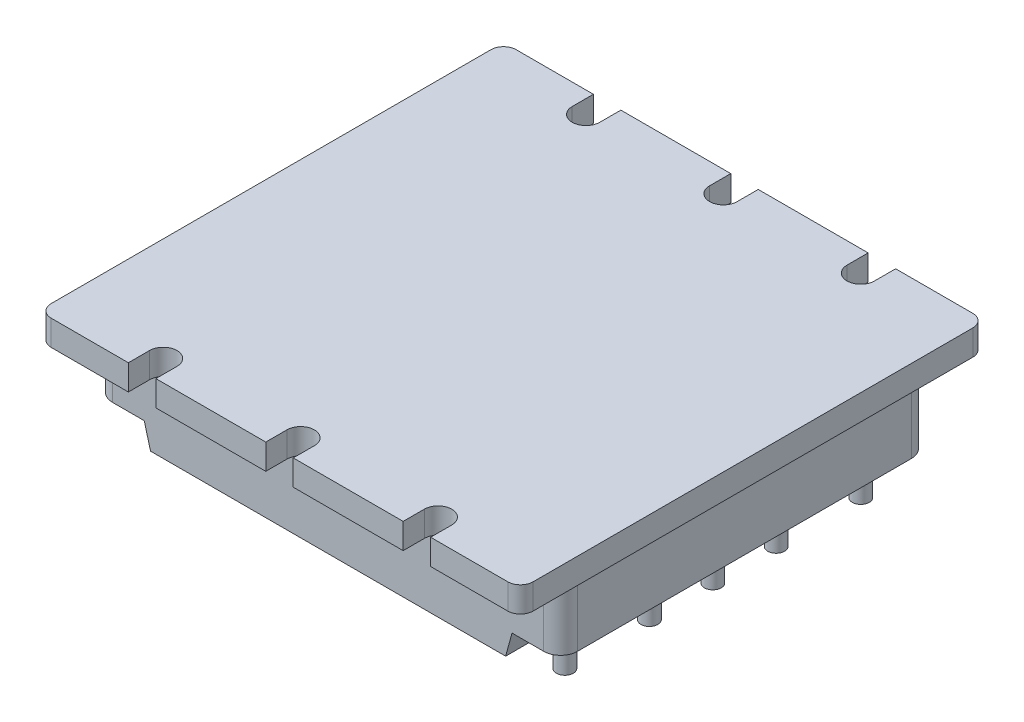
ISO-10303-21;
HEADER;
FILE_DESCRIPTION(('STEP AP214'),'2;1');
FILE_NAME('part.step','',(''),(''),'','','');
FILE_SCHEMA(('AUTOMOTIVE_DESIGN { 1 0 10303 214 1 1 1 1 }'));
ENDSEC;
DATA;
#1=APPLICATION_CONTEXT('core data for automotive mechanical design processes');
#2=APPLICATION_PROTOCOL_DEFINITION('international standard','automotive_design',2000,#1);
#3=PRODUCT_CONTEXT('',#1,'mechanical');
#4=PRODUCT('Part','Part','',(#3));
#5=PRODUCT_RELATED_PRODUCT_CATEGORY('part','',(#4));
#6=PRODUCT_DEFINITION_FORMATION('','',#4);
#7=PRODUCT_DEFINITION_CONTEXT('part definition',#1,'design');
#8=PRODUCT_DEFINITION('design','',#6,#7);
#9=PRODUCT_DEFINITION_SHAPE('','',#8);
#10=(LENGTH_UNIT() NAMED_UNIT(*) SI_UNIT(.MILLI.,.METRE.));
#11=(NAMED_UNIT(*) PLANE_ANGLE_UNIT() SI_UNIT($,.RADIAN.));
#12=(NAMED_UNIT(*) SI_UNIT($,.STERADIAN.) SOLID_ANGLE_UNIT());
#13=UNCERTAINTY_MEASURE_WITH_UNIT(LENGTH_MEASURE(1.E-05),#10,'distance_accuracy_value','');
#14=(GEOMETRIC_REPRESENTATION_CONTEXT(3) GLOBAL_UNCERTAINTY_ASSIGNED_CONTEXT((#13)) GLOBAL_UNIT_ASSIGNED_CONTEXT((#10,
#11,#12)) REPRESENTATION_CONTEXT('',''));
#15=CARTESIAN_POINT('',(0.,0.,0.));
#16=DIRECTION('',(0.,0.,1.));
#17=DIRECTION('',(1.,0.,0.));
#18=AXIS2_PLACEMENT_3D('',#15,#16,#17);
#19=CARTESIAN_POINT('',(52.07,2.794,-4.318));
#20=DIRECTION('',(0.,1.,0.));
#21=DIRECTION('',(-1.,0.,0.));
#22=AXIS2_PLACEMENT_3D('',#19,#20,#21);
#23=PLANE('',#22);
#24=CARTESIAN_POINT('',(48.26,2.794,35.56));
#25=DIRECTION('',(0.,1.,0.));
#26=DIRECTION('',(-1.,0.,0.));
#27=AXIS2_PLACEMENT_3D('',#24,#25,#26);
#28=CIRCLE('',#27,1.016);
#29=CARTESIAN_POINT('',(47.244,2.794,35.56));
#30=VERTEX_POINT('',#29);
#31=EDGE_CURVE('E22',#30,#30,#28,.F.);
#32=ORIENTED_EDGE('',*,*,#31,.F.);
#33=EDGE_LOOP('',(#32));
#34=FACE_BOUND('',#33,.T.);
#35=CARTESIAN_POINT('',(48.26,2.794,10.16));
#36=DIRECTION('',(0.,1.,0.));
#37=DIRECTION('',(-1.,0.,0.));
#38=AXIS2_PLACEMENT_3D('',#35,#36,#37);
#39=CIRCLE('',#38,1.016);
#40=CARTESIAN_POINT('',(47.244,2.794,10.16));
#41=VERTEX_POINT('',#40);
#42=EDGE_CURVE('E637',#41,#41,#39,.F.);
#43=ORIENTED_EDGE('',*,*,#42,.F.);
#44=EDGE_LOOP('',(#43));
#45=FACE_BOUND('',#44,.T.);
#46=DIRECTION('',(-1.,0.,0.));
#47=VECTOR('',#46,1.);
#48=CARTESIAN_POINT('',(52.07,2.794,39.878));
#49=LINE('',#48,#47);
#50=CARTESIAN_POINT('',(50.038,2.794,39.878));
#51=VERTEX_POINT('',#50);
#52=CARTESIAN_POINT('',(46.228,2.794,39.878));
#53=VERTEX_POINT('',#52);
#54=EDGE_CURVE('E527',#51,#53,#49,.T.);
#55=ORIENTED_EDGE('',*,*,#54,.T.);
#56=DIRECTION('',(0.,0.,1.));
#57=VECTOR('',#56,1.);
#58=CARTESIAN_POINT('',(46.228,2.794,-4.318));
#59=LINE('',#58,#57);
#60=CARTESIAN_POINT('',(46.228,2.794,-4.318));
#61=VERTEX_POINT('',#60);
#62=EDGE_CURVE('E542',#61,#53,#59,.T.);
#63=ORIENTED_EDGE('',*,*,#62,.F.);
#64=DIRECTION('',(-1.,0.,0.));
#65=VECTOR('',#64,1.);
#66=CARTESIAN_POINT('',(52.07,2.794,-4.318));
#67=LINE('',#66,#65);
#68=CARTESIAN_POINT('',(50.038,2.794,-4.318));
#69=VERTEX_POINT('',#68);
#70=EDGE_CURVE('E531',#69,#61,#67,.T.);
#71=ORIENTED_EDGE('',*,*,#70,.F.);
#72=CARTESIAN_POINT('',(50.038,2.794,-2.286));
#73=DIRECTION('',(0.,1.,0.));
#74=DIRECTION('',(-1.,0.,0.));
#75=AXIS2_PLACEMENT_3D('',#72,#73,#74);
#76=CIRCLE('',#75,2.032);
#77=CARTESIAN_POINT('',(52.07,2.794,-2.286));
#78=VERTEX_POINT('',#77);
#79=EDGE_CURVE('E541',#78,#69,#76,.T.);
#80=ORIENTED_EDGE('',*,*,#79,.F.);
#81=DIRECTION('',(0.,0.,1.));
#82=VECTOR('',#81,1.);
#83=CARTESIAN_POINT('',(52.07,2.794,-4.318));
#84=LINE('',#83,#82);
#85=CARTESIAN_POINT('',(52.07,2.794,37.846));
#86=VERTEX_POINT('',#85);
#87=EDGE_CURVE('E537',#78,#86,#84,.T.);
#88=ORIENTED_EDGE('',*,*,#87,.T.);
#89=CARTESIAN_POINT('',(50.038,2.794,37.846));
#90=DIRECTION('',(0.,1.,0.));
#91=DIRECTION('',(-1.,0.,0.));
#92=AXIS2_PLACEMENT_3D('',#89,#90,#91);
#93=CIRCLE('',#92,2.032);
#94=EDGE_CURVE('E548',#51,#86,#93,.T.);
#95=ORIENTED_EDGE('',*,*,#94,.F.);
#96=EDGE_LOOP('',(#55,#63,#71,#80,#88,#95));
#97=FACE_BOUND('',#96,.T.);
#98=CARTESIAN_POINT('',(48.26,2.794,0.));
#99=DIRECTION('',(0.,1.,0.));
#100=DIRECTION('',(-1.,0.,0.));
#101=AXIS2_PLACEMENT_3D('',#98,#99,#100);
#102=CIRCLE('',#101,1.016);
#103=CARTESIAN_POINT('',(47.244,2.794,0.));
#104=VERTEX_POINT('',#103);
#105=EDGE_CURVE('E634',#104,#104,#102,.F.);
#106=ORIENTED_EDGE('',*,*,#105,.F.);
#107=EDGE_LOOP('',(#106));
#108=FACE_BOUND('',#107,.T.);
#109=CARTESIAN_POINT('',(48.26,2.794,25.4));
#110=DIRECTION('',(0.,1.,0.));
#111=DIRECTION('',(-1.,0.,0.));
#112=AXIS2_PLACEMENT_3D('',#109,#110,#111);
#113=CIRCLE('',#112,1.016);
#114=CARTESIAN_POINT('',(47.244,2.794,25.4));
#115=VERTEX_POINT('',#114);
#116=EDGE_CURVE('E643',#115,#115,#113,.F.);
#117=ORIENTED_EDGE('',*,*,#116,.F.);
#118=EDGE_LOOP('',(#117));
#119=FACE_BOUND('',#118,.T.);
#120=CARTESIAN_POINT('',(48.26,2.794,17.78));
#121=DIRECTION('',(0.,1.,0.));
#122=DIRECTION('',(-1.,0.,0.));
#123=AXIS2_PLACEMENT_3D('',#120,#121,#122);
#124=CIRCLE('',#123,1.016);
#125=CARTESIAN_POINT('',(47.244,2.794,17.78));
#126=VERTEX_POINT('',#125);
#127=EDGE_CURVE('E9',#126,#126,#124,.F.);
#128=ORIENTED_EDGE('',*,*,#127,.F.);
#129=EDGE_LOOP('',(#128));
#130=FACE_BOUND('',#129,.T.);
#131=ADVANCED_FACE('F14',(#34,#45,#97,#108,#119,#130),#23,.F.);
#132=CARTESIAN_POINT('',(-3.81,2.794,-4.318));
#133=DIRECTION('',(0.,1.,0.));
#134=DIRECTION('',(-1.,0.,0.));
#135=AXIS2_PLACEMENT_3D('',#132,#133,#134);
#136=PLANE('',#135);
#137=CARTESIAN_POINT('',(0.,2.794,25.4));
#138=DIRECTION('',(0.,1.,0.));
#139=DIRECTION('',(-1.,0.,0.));
#140=AXIS2_PLACEMENT_3D('',#137,#138,#139);
#141=CIRCLE('',#140,1.016);
#142=CARTESIAN_POINT('',(-1.016,2.794,25.4));
#143=VERTEX_POINT('',#142);
#144=EDGE_CURVE('E640',#143,#143,#141,.F.);
#145=ORIENTED_EDGE('',*,*,#144,.F.);
#146=EDGE_LOOP('',(#145));
#147=FACE_BOUND('',#146,.T.);
#148=CARTESIAN_POINT('',(0.,2.794,0.));
#149=DIRECTION('',(0.,1.,0.));
#150=DIRECTION('',(-1.,0.,0.));
#151=AXIS2_PLACEMENT_3D('',#148,#149,#150);
#152=CIRCLE('',#151,1.016);
#153=CARTESIAN_POINT('',(-1.016,2.794,0.));
#154=VERTEX_POINT('',#153);
#155=EDGE_CURVE('E628',#154,#154,#152,.F.);
#156=ORIENTED_EDGE('',*,*,#155,.F.);
#157=EDGE_LOOP('',(#156));
#158=FACE_BOUND('',#157,.T.);
#159=DIRECTION('',(0.,0.,1.));
#160=VECTOR('',#159,1.);
#161=CARTESIAN_POINT('',(-3.81,2.794,-4.318));
#162=LINE('',#161,#160);
#163=CARTESIAN_POINT('',(-3.81,2.794,-2.286));
#164=VERTEX_POINT('',#163);
#165=CARTESIAN_POINT('',(-3.81,2.794,37.846));
#166=VERTEX_POINT('',#165);
#167=EDGE_CURVE('E563',#164,#166,#162,.T.);
#168=ORIENTED_EDGE('',*,*,#167,.F.);
#169=CARTESIAN_POINT('',(-1.778,2.794,-2.286));
#170=DIRECTION('',(0.,1.,0.));
#171=DIRECTION('',(-1.,0.,0.));
#172=AXIS2_PLACEMENT_3D('',#169,#170,#171);
#173=CIRCLE('',#172,2.032);
#174=CARTESIAN_POINT('',(-1.778,2.794,-4.318));
#175=VERTEX_POINT('',#174);
#176=EDGE_CURVE('E566',#175,#164,#173,.T.);
#177=ORIENTED_EDGE('',*,*,#176,.F.);
#178=DIRECTION('',(-1.,0.,0.));
#179=VECTOR('',#178,1.);
#180=CARTESIAN_POINT('',(-3.81,2.794,-4.318));
#181=LINE('',#180,#179);
#182=CARTESIAN_POINT('',(2.032,2.794,-4.318));
#183=VERTEX_POINT('',#182);
#184=EDGE_CURVE('E559',#183,#175,#181,.T.);
#185=ORIENTED_EDGE('',*,*,#184,.F.);
#186=DIRECTION('',(0.,0.,1.));
#187=VECTOR('',#186,1.);
#188=CARTESIAN_POINT('',(2.032,2.794,-4.318));
#189=LINE('',#188,#187);
#190=CARTESIAN_POINT('',(2.032,2.794,39.878));
#191=VERTEX_POINT('',#190);
#192=EDGE_CURVE('E567',#183,#191,#189,.T.);
#193=ORIENTED_EDGE('',*,*,#192,.T.);
#194=DIRECTION('',(-1.,0.,0.));
#195=VECTOR('',#194,1.);
#196=CARTESIAN_POINT('',(-3.81,2.794,39.878));
#197=LINE('',#196,#195);
#198=CARTESIAN_POINT('',(-1.778,2.794,39.878));
#199=VERTEX_POINT('',#198);
#200=EDGE_CURVE('E554',#191,#199,#197,.T.);
#201=ORIENTED_EDGE('',*,*,#200,.T.);
#202=CARTESIAN_POINT('',(-1.778,2.794,37.846));
#203=DIRECTION('',(0.,1.,0.));
#204=DIRECTION('',(-1.,0.,0.));
#205=AXIS2_PLACEMENT_3D('',#202,#203,#204);
#206=CIRCLE('',#205,2.032);
#207=EDGE_CURVE('E572',#166,#199,#206,.T.);
#208=ORIENTED_EDGE('',*,*,#207,.F.);
#209=EDGE_LOOP('',(#168,#177,#185,#193,#201,#208));
#210=FACE_BOUND('',#209,.T.);
#211=CARTESIAN_POINT('',(0.,2.794,10.16));
#212=DIRECTION('',(0.,1.,0.));
#213=DIRECTION('',(-1.,0.,0.));
#214=AXIS2_PLACEMENT_3D('',#211,#212,#213);
#215=CIRCLE('',#214,1.016);
#216=CARTESIAN_POINT('',(-1.016,2.794,10.16));
#217=VERTEX_POINT('',#216);
#218=EDGE_CURVE('E631',#217,#217,#215,.F.);
#219=ORIENTED_EDGE('',*,*,#218,.F.);
#220=EDGE_LOOP('',(#219));
#221=FACE_BOUND('',#220,.T.);
#222=CARTESIAN_POINT('',(0.,2.794,35.56));
#223=DIRECTION('',(0.,1.,0.));
#224=DIRECTION('',(-1.,0.,0.));
#225=AXIS2_PLACEMENT_3D('',#222,#223,#224);
#226=CIRCLE('',#225,1.016);
#227=CARTESIAN_POINT('',(-1.01599999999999,2.794,35.56));
#228=VERTEX_POINT('',#227);
#229=EDGE_CURVE('E646',#228,#228,#226,.F.);
#230=ORIENTED_EDGE('',*,*,#229,.F.);
#231=EDGE_LOOP('',(#230));
#232=FACE_BOUND('',#231,.T.);
#233=ADVANCED_FACE('F655',(#147,#158,#210,#221,#232),#136,.F.);
#234=CARTESIAN_POINT('',(-3.302,13.716,45.72));
#235=DIRECTION('',(0.,0.,-1.));
#236=DIRECTION('',(-1.,0.,0.));
#237=AXIS2_PLACEMENT_3D('',#234,#235,#236);
#238=PLANE('',#237);
#239=DIRECTION('',(1.,0.,0.));
#240=VECTOR('',#239,1.);
#241=CARTESIAN_POINT('',(-3.302,13.716,45.72));
#242=LINE('',#241,#240);
#243=CARTESIAN_POINT('',(9.271,13.716,45.72));
#244=VERTEX_POINT('',#243);
#245=CARTESIAN_POINT('',(22.479,13.716,45.72));
#246=VERTEX_POINT('',#245);
#247=EDGE_CURVE('E488',#244,#246,#242,.T.);
#248=ORIENTED_EDGE('',*,*,#247,.F.);
#249=DIRECTION('',(0.,1.,0.));
#250=VECTOR('',#249,1.);
#251=CARTESIAN_POINT('',(9.271,-0.000999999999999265,45.72));
#252=LINE('',#251,#250);
#253=CARTESIAN_POINT('',(9.271,10.668,45.72));
#254=VERTEX_POINT('',#253);
#255=EDGE_CURVE('E331',#254,#244,#252,.T.);
#256=ORIENTED_EDGE('',*,*,#255,.F.);
#257=DIRECTION('',(1.,0.,0.));
#258=VECTOR('',#257,1.);
#259=CARTESIAN_POINT('',(-3.302,10.668,45.72));
#260=LINE('',#259,#258);
#261=CARTESIAN_POINT('',(22.479,10.668,45.72));
#262=VERTEX_POINT('',#261);
#263=EDGE_CURVE('E465',#254,#262,#260,.T.);
#264=ORIENTED_EDGE('',*,*,#263,.T.);
#265=DIRECTION('',(0.,1.,0.));
#266=VECTOR('',#265,1.);
#267=CARTESIAN_POINT('',(22.479,-0.000999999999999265,45.72));
#268=LINE('',#267,#266);
#269=EDGE_CURVE('E375',#262,#246,#268,.T.);
#270=ORIENTED_EDGE('',*,*,#269,.T.);
#271=EDGE_LOOP('',(#248,#256,#264,#270));
#272=FACE_BOUND('',#271,.T.);
#273=ADVANCED_FACE('F848',(#272),#238,.F.);
#274=CARTESIAN_POINT('',(-3.302,13.716,-10.16));
#275=DIRECTION('',(0.,0.,1.));
#276=DIRECTION('',(1.,0.,0.));
#277=AXIS2_PLACEMENT_3D('',#274,#275,#276);
#278=PLANE('',#277);
#279=DIRECTION('',(-1.,0.,0.));
#280=VECTOR('',#279,1.);
#281=CARTESIAN_POINT('',(-3.302,13.716,-10.16));
#282=LINE('',#281,#280);
#283=CARTESIAN_POINT('',(5.969,13.716,-10.16));
#284=VERTEX_POINT('',#283);
#285=CARTESIAN_POINT('',(-3.302,13.716,-10.16));
#286=VERTEX_POINT('',#285);
#287=EDGE_CURVE('E494',#284,#286,#282,.T.);
#288=ORIENTED_EDGE('',*,*,#287,.F.);
#289=DIRECTION('',(0.,1.,0.));
#290=VECTOR('',#289,1.);
#291=CARTESIAN_POINT('',(5.969,-0.000999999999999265,-10.16));
#292=LINE('',#291,#290);
#293=CARTESIAN_POINT('',(5.969,10.668,-10.16));
#294=VERTEX_POINT('',#293);
#295=EDGE_CURVE('E348',#294,#284,#292,.T.);
#296=ORIENTED_EDGE('',*,*,#295,.F.);
#297=DIRECTION('',(-1.,0.,0.));
#298=VECTOR('',#297,1.);
#299=CARTESIAN_POINT('',(-3.302,10.668,-10.16));
#300=LINE('',#299,#298);
#301=CARTESIAN_POINT('',(-3.302,10.668,-10.16));
#302=VERTEX_POINT('',#301);
#303=EDGE_CURVE('E471',#294,#302,#300,.T.);
#304=ORIENTED_EDGE('',*,*,#303,.T.);
#305=DIRECTION('',(0.,-1.,0.));
#306=VECTOR('',#305,1.);
#307=CARTESIAN_POINT('',(-3.302,13.716,-10.16));
#308=LINE('',#307,#306);
#309=EDGE_CURVE('E509',#286,#302,#308,.T.);
#310=ORIENTED_EDGE('',*,*,#309,.F.);
#311=EDGE_LOOP('',(#288,#296,#304,#310));
#312=FACE_BOUND('',#311,.T.);
#313=ADVANCED_FACE('F831',(#312),#278,.F.);
#314=CARTESIAN_POINT('',(25.781,13.716,45.72));
#315=VERTEX_POINT('',#314);
#316=CARTESIAN_POINT('',(38.989,13.716,45.72));
#317=VERTEX_POINT('',#316);
#318=EDGE_CURVE('E988',#315,#317,#242,.T.);
#319=ORIENTED_EDGE('',*,*,#318,.F.);
#320=DIRECTION('',(0.,1.,0.));
#321=VECTOR('',#320,1.);
#322=CARTESIAN_POINT('',(25.781,-0.000999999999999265,45.72));
#323=LINE('',#322,#321);
#324=CARTESIAN_POINT('',(25.781,10.668,45.72));
#325=VERTEX_POINT('',#324);
#326=EDGE_CURVE('E373',#325,#315,#323,.T.);
#327=ORIENTED_EDGE('',*,*,#326,.F.);
#328=CARTESIAN_POINT('',(38.989,10.668,45.72));
#329=VERTEX_POINT('',#328);
#330=EDGE_CURVE('E1014',#325,#329,#260,.T.);
#331=ORIENTED_EDGE('',*,*,#330,.T.);
#332=DIRECTION('',(0.,1.,0.));
#333=VECTOR('',#332,1.);
#334=CARTESIAN_POINT('',(38.989,-0.000999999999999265,45.72));
#335=LINE('',#334,#333);
#336=EDGE_CURVE('E426',#329,#317,#335,.T.);
#337=ORIENTED_EDGE('',*,*,#336,.T.);
#338=EDGE_LOOP('',(#319,#327,#331,#337));
#339=FACE_BOUND('',#338,.T.);
#340=ADVANCED_FACE('F931',(#339),#238,.F.);
#341=CARTESIAN_POINT('',(22.479,10.668,-10.16));
#342=VERTEX_POINT('',#341);
#343=CARTESIAN_POINT('',(9.271,10.668,-10.16));
#344=VERTEX_POINT('',#343);
#345=EDGE_CURVE('E972',#342,#344,#300,.T.);
#346=ORIENTED_EDGE('',*,*,#345,.T.);
#347=DIRECTION('',(0.,1.,0.));
#348=VECTOR('',#347,1.);
#349=CARTESIAN_POINT('',(9.271,-0.000999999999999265,-10.16));
#350=LINE('',#349,#348);
#351=CARTESIAN_POINT('',(9.271,13.716,-10.16));
#352=VERTEX_POINT('',#351);
#353=EDGE_CURVE('E350',#344,#352,#350,.T.);
#354=ORIENTED_EDGE('',*,*,#353,.T.);
#355=CARTESIAN_POINT('',(22.479,13.716,-10.16));
#356=VERTEX_POINT('',#355);
#357=EDGE_CURVE('E952',#356,#352,#282,.T.);
#358=ORIENTED_EDGE('',*,*,#357,.F.);
#359=DIRECTION('',(0.,1.,0.));
#360=VECTOR('',#359,1.);
#361=CARTESIAN_POINT('',(22.479,-0.000999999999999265,-10.16));
#362=LINE('',#361,#360);
#363=EDGE_CURVE('E398',#342,#356,#362,.T.);
#364=ORIENTED_EDGE('',*,*,#363,.F.);
#365=EDGE_LOOP('',(#346,#354,#358,#364));
#366=FACE_BOUND('',#365,.T.);
#367=ADVANCED_FACE('F926',(#366),#278,.F.);
#368=CARTESIAN_POINT('',(42.291,13.716,45.72));
#369=VERTEX_POINT('',#368);
#370=CARTESIAN_POINT('',(51.562,13.716,45.72));
#371=VERTEX_POINT('',#370);
#372=EDGE_CURVE('E483',#369,#371,#242,.T.);
#373=ORIENTED_EDGE('',*,*,#372,.F.);
#374=DIRECTION('',(0.,1.,0.));
#375=VECTOR('',#374,1.);
#376=CARTESIAN_POINT('',(42.291,-0.000999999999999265,45.72));
#377=LINE('',#376,#375);
#378=CARTESIAN_POINT('',(42.291,10.668,45.72));
#379=VERTEX_POINT('',#378);
#380=EDGE_CURVE('E424',#379,#369,#377,.T.);
#381=ORIENTED_EDGE('',*,*,#380,.F.);
#382=CARTESIAN_POINT('',(51.562,10.668,45.72));
#383=VERTEX_POINT('',#382);
#384=EDGE_CURVE('E461',#379,#383,#260,.T.);
#385=ORIENTED_EDGE('',*,*,#384,.T.);
#386=DIRECTION('',(0.,-1.,0.));
#387=VECTOR('',#386,1.);
#388=CARTESIAN_POINT('',(51.562,13.716,45.72));
#389=LINE('',#388,#387);
#390=EDGE_CURVE('E521',#371,#383,#389,.T.);
#391=ORIENTED_EDGE('',*,*,#390,.F.);
#392=EDGE_LOOP('',(#373,#381,#385,#391));
#393=FACE_BOUND('',#392,.T.);
#394=ADVANCED_FACE('F849',(#393),#238,.F.);
#395=CARTESIAN_POINT('',(38.989,10.668,-10.16));
#396=VERTEX_POINT('',#395);
#397=CARTESIAN_POINT('',(25.781,10.668,-10.16));
#398=VERTEX_POINT('',#397);
#399=EDGE_CURVE('E476',#396,#398,#300,.T.);
#400=ORIENTED_EDGE('',*,*,#399,.T.);
#401=DIRECTION('',(0.,1.,0.));
#402=VECTOR('',#401,1.);
#403=CARTESIAN_POINT('',(25.781,-0.000999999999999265,-10.16));
#404=LINE('',#403,#402);
#405=CARTESIAN_POINT('',(25.781,13.716,-10.16));
#406=VERTEX_POINT('',#405);
#407=EDGE_CURVE('E400',#398,#406,#404,.T.);
#408=ORIENTED_EDGE('',*,*,#407,.T.);
#409=CARTESIAN_POINT('',(38.989,13.716,-10.16));
#410=VERTEX_POINT('',#409);
#411=EDGE_CURVE('E499',#410,#406,#282,.T.);
#412=ORIENTED_EDGE('',*,*,#411,.F.);
#413=DIRECTION('',(0.,1.,0.));
#414=VECTOR('',#413,1.);
#415=CARTESIAN_POINT('',(38.989,-0.000999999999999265,-10.16));
#416=LINE('',#415,#414);
#417=EDGE_CURVE('E449',#396,#410,#416,.T.);
#418=ORIENTED_EDGE('',*,*,#417,.F.);
#419=EDGE_LOOP('',(#400,#408,#412,#418));
#420=FACE_BOUND('',#419,.T.);
#421=ADVANCED_FACE('F832',(#420),#278,.F.);
#422=CARTESIAN_POINT('',(-1.778,10.668,37.846));
#423=DIRECTION('',(0.,-1.,0.));
#424=DIRECTION('',(0.,0.,-1.));
#425=AXIS2_PLACEMENT_3D('',#422,#423,#424);
#426=CYLINDRICAL_SURFACE('',#425,2.032);
#427=DIRECTION('',(0.,-1.,0.));
#428=VECTOR('',#427,1.);
#429=CARTESIAN_POINT('',(-3.81,10.668,37.846));
#430=LINE('',#429,#428);
#431=CARTESIAN_POINT('',(-3.81,10.668,37.846));
#432=VERTEX_POINT('',#431);
#433=EDGE_CURVE('E604',#432,#166,#430,.T.);
#434=ORIENTED_EDGE('',*,*,#433,.T.);
#435=ORIENTED_EDGE('',*,*,#207,.T.);
#436=DIRECTION('',(0.,-1.,0.));
#437=VECTOR('',#436,1.);
#438=CARTESIAN_POINT('',(-1.778,10.668,39.878));
#439=LINE('',#438,#437);
#440=CARTESIAN_POINT('',(-1.778,10.668,39.878));
#441=VERTEX_POINT('',#440);
#442=EDGE_CURVE('E625',#441,#199,#439,.T.);
#443=ORIENTED_EDGE('',*,*,#442,.F.);
#444=CARTESIAN_POINT('',(-1.778,10.668,37.846));
#445=DIRECTION('',(0.,1.,0.));
#446=DIRECTION('',(0.,0.,1.));
#447=AXIS2_PLACEMENT_3D('',#444,#445,#446);
#448=CIRCLE('',#447,2.032);
#449=EDGE_CURVE('E580',#432,#441,#448,.T.);
#450=ORIENTED_EDGE('',*,*,#449,.F.);
#451=EDGE_LOOP('',(#434,#435,#443,#450));
#452=FACE_BOUND('',#451,.T.);
#453=ADVANCED_FACE('F16',(#452),#426,.T.);
#454=CARTESIAN_POINT('',(-1.778,10.668,39.878));
#455=DIRECTION('',(0.,0.,-1.));
#456=DIRECTION('',(-1.,0.,0.));
#457=AXIS2_PLACEMENT_3D('',#454,#455,#456);
#458=PLANE('',#457);
#459=DIRECTION('',(1.,0.,0.));
#460=VECTOR('',#459,1.);
#461=CARTESIAN_POINT('',(-1.778,0.,39.878));
#462=LINE('',#461,#460);
#463=CARTESIAN_POINT('',(2.794,0.,39.878));
#464=VERTEX_POINT('',#463);
#465=CARTESIAN_POINT('',(45.466,0.,39.878));
#466=VERTEX_POINT('',#465);
#467=EDGE_CURVE('E575',#464,#466,#462,.T.);
#468=ORIENTED_EDGE('',*,*,#467,.T.);
#469=DIRECTION('',(-0.263117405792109,-0.964763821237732,0.));
#470=VECTOR('',#469,1.);
#471=CARTESIAN_POINT('',(46.228,2.794,39.878));
#472=LINE('',#471,#470);
#473=EDGE_CURVE('E529',#53,#466,#472,.T.);
#474=ORIENTED_EDGE('',*,*,#473,.F.);
#475=ORIENTED_EDGE('',*,*,#54,.F.);
#476=DIRECTION('',(0.,-1.,0.));
#477=VECTOR('',#476,1.);
#478=CARTESIAN_POINT('',(50.038,10.668,39.878));
#479=LINE('',#478,#477);
#480=CARTESIAN_POINT('',(50.038,10.668,39.878));
#481=VERTEX_POINT('',#480);
#482=EDGE_CURVE('E622',#481,#51,#479,.T.);
#483=ORIENTED_EDGE('',*,*,#482,.F.);
#484=DIRECTION('',(1.,0.,0.));
#485=VECTOR('',#484,1.);
#486=CARTESIAN_POINT('',(-1.778,10.668,39.878));
#487=LINE('',#486,#485);
#488=EDGE_CURVE('E583',#441,#481,#487,.T.);
#489=ORIENTED_EDGE('',*,*,#488,.F.);
#490=ORIENTED_EDGE('',*,*,#442,.T.);
#491=ORIENTED_EDGE('',*,*,#200,.F.);
#492=DIRECTION('',(-0.263117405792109,0.964763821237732,0.));
#493=VECTOR('',#492,1.);
#494=CARTESIAN_POINT('',(2.032,2.794,39.878));
#495=LINE('',#494,#493);
#496=EDGE_CURVE('E551',#464,#191,#495,.T.);
#497=ORIENTED_EDGE('',*,*,#496,.F.);
#498=EDGE_LOOP('',(#468,#474,#475,#483,#489,#490,#491,#497));
#499=FACE_BOUND('',#498,.T.);
#500=ADVANCED_FACE('F889',(#499),#458,.F.);
#501=CARTESIAN_POINT('',(50.038,10.668,37.846));
#502=DIRECTION('',(0.,-1.,0.));
#503=DIRECTION('',(0.,0.,-1.));
#504=AXIS2_PLACEMENT_3D('',#501,#502,#503);
#505=CYLINDRICAL_SURFACE('',#504,2.032);
#506=ORIENTED_EDGE('',*,*,#482,.T.);
#507=ORIENTED_EDGE('',*,*,#94,.T.);
#508=DIRECTION('',(0.,-1.,0.));
#509=VECTOR('',#508,1.);
#510=CARTESIAN_POINT('',(52.07,10.668,37.846));
#511=LINE('',#510,#509);
#512=CARTESIAN_POINT('',(52.07,10.668,37.846));
#513=VERTEX_POINT('',#512);
#514=EDGE_CURVE('E619',#513,#86,#511,.T.);
#515=ORIENTED_EDGE('',*,*,#514,.F.);
#516=CARTESIAN_POINT('',(50.038,10.668,37.846));
#517=DIRECTION('',(0.,1.,0.));
#518=DIRECTION('',(0.,0.,-1.));
#519=AXIS2_PLACEMENT_3D('',#516,#517,#518);
#520=CIRCLE('',#519,2.032);
#521=EDGE_CURVE('E586',#481,#513,#520,.T.);
#522=ORIENTED_EDGE('',*,*,#521,.F.);
#523=EDGE_LOOP('',(#506,#507,#515,#522));
#524=FACE_BOUND('',#523,.T.);
#525=ADVANCED_FACE('F886',(#524),#505,.T.);
#526=CARTESIAN_POINT('',(52.07,10.668,37.846));
#527=DIRECTION('',(-1.,0.,0.));
#528=DIRECTION('',(0.,0.,1.));
#529=AXIS2_PLACEMENT_3D('',#526,#527,#528);
#530=PLANE('',#529);
#531=ORIENTED_EDGE('',*,*,#514,.T.);
#532=ORIENTED_EDGE('',*,*,#87,.F.);
#533=DIRECTION('',(0.,-1.,0.));
#534=VECTOR('',#533,1.);
#535=CARTESIAN_POINT('',(52.07,10.668,-2.286));
#536=LINE('',#535,#534);
#537=CARTESIAN_POINT('',(52.07,10.668,-2.286));
#538=VERTEX_POINT('',#537);
#539=EDGE_CURVE('E616',#538,#78,#536,.T.);
#540=ORIENTED_EDGE('',*,*,#539,.F.);
#541=DIRECTION('',(0.,0.,-1.));
#542=VECTOR('',#541,1.);
#543=CARTESIAN_POINT('',(52.07,10.668,37.846));
#544=LINE('',#543,#542);
#545=EDGE_CURVE('E589',#513,#538,#544,.T.);
#546=ORIENTED_EDGE('',*,*,#545,.F.);
#547=EDGE_LOOP('',(#531,#532,#540,#546));
#548=FACE_BOUND('',#547,.T.);
#549=ADVANCED_FACE('F882',(#548),#530,.F.);
#550=CARTESIAN_POINT('',(50.038,10.668,-2.286));
#551=DIRECTION('',(0.,-1.,0.));
#552=DIRECTION('',(0.,0.,-1.));
#553=AXIS2_PLACEMENT_3D('',#550,#551,#552);
#554=CYLINDRICAL_SURFACE('',#553,2.032);
#555=ORIENTED_EDGE('',*,*,#539,.T.);
#556=ORIENTED_EDGE('',*,*,#79,.T.);
#557=DIRECTION('',(0.,-1.,0.));
#558=VECTOR('',#557,1.);
#559=CARTESIAN_POINT('',(50.038,10.668,-4.318));
#560=LINE('',#559,#558);
#561=CARTESIAN_POINT('',(50.038,10.668,-4.318));
#562=VERTEX_POINT('',#561);
#563=EDGE_CURVE('E613',#562,#69,#560,.T.);
#564=ORIENTED_EDGE('',*,*,#563,.F.);
#565=CARTESIAN_POINT('',(50.038,10.668,-2.286));
#566=DIRECTION('',(0.,1.,0.));
#567=DIRECTION('',(0.,0.,1.));
#568=AXIS2_PLACEMENT_3D('',#565,#566,#567);
#569=CIRCLE('',#568,2.032);
#570=EDGE_CURVE('E592',#538,#562,#569,.T.);
#571=ORIENTED_EDGE('',*,*,#570,.F.);
#572=EDGE_LOOP('',(#555,#556,#564,#571));
#573=FACE_BOUND('',#572,.T.);
#574=ADVANCED_FACE('F878',(#573),#554,.T.);
#575=CARTESIAN_POINT('',(-1.778,10.668,-4.318));
#576=DIRECTION('',(0.,0.,1.));
#577=DIRECTION('',(1.,0.,0.));
#578=AXIS2_PLACEMENT_3D('',#575,#576,#577);
#579=PLANE('',#578);
#580=ORIENTED_EDGE('',*,*,#70,.T.);
#581=DIRECTION('',(-0.263117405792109,-0.964763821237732,0.));
#582=VECTOR('',#581,1.);
#583=CARTESIAN_POINT('',(46.228,2.794,-4.318));
#584=LINE('',#583,#582);
#585=CARTESIAN_POINT('',(45.466,0.,-4.318));
#586=VERTEX_POINT('',#585);
#587=EDGE_CURVE('E534',#61,#586,#584,.T.);
#588=ORIENTED_EDGE('',*,*,#587,.T.);
#589=DIRECTION('',(-1.,0.,0.));
#590=VECTOR('',#589,1.);
#591=CARTESIAN_POINT('',(-1.778,0.,-4.318));
#592=LINE('',#591,#590);
#593=CARTESIAN_POINT('',(2.794,0.,-4.318));
#594=VERTEX_POINT('',#593);
#595=EDGE_CURVE('E578',#586,#594,#592,.T.);
#596=ORIENTED_EDGE('',*,*,#595,.T.);
#597=DIRECTION('',(-0.263117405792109,0.964763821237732,0.));
#598=VECTOR('',#597,1.);
#599=CARTESIAN_POINT('',(2.032,2.794,-4.318));
#600=LINE('',#599,#598);
#601=EDGE_CURVE('E556',#594,#183,#600,.T.);
#602=ORIENTED_EDGE('',*,*,#601,.T.);
#603=ORIENTED_EDGE('',*,*,#184,.T.);
#604=DIRECTION('',(0.,-1.,0.));
#605=VECTOR('',#604,1.);
#606=CARTESIAN_POINT('',(-1.778,10.668,-4.318));
#607=LINE('',#606,#605);
#608=CARTESIAN_POINT('',(-1.778,10.668,-4.318));
#609=VERTEX_POINT('',#608);
#610=EDGE_CURVE('E610',#609,#175,#607,.T.);
#611=ORIENTED_EDGE('',*,*,#610,.F.);
#612=DIRECTION('',(-1.,0.,0.));
#613=VECTOR('',#612,1.);
#614=CARTESIAN_POINT('',(-1.778,10.668,-4.318));
#615=LINE('',#614,#613);
#616=EDGE_CURVE('E595',#562,#609,#615,.T.);
#617=ORIENTED_EDGE('',*,*,#616,.F.);
#618=ORIENTED_EDGE('',*,*,#563,.T.);
#619=EDGE_LOOP('',(#580,#588,#596,#602,#603,#611,#617,#618));
#620=FACE_BOUND('',#619,.T.);
#621=ADVANCED_FACE('F874',(#620),#579,.F.);
#622=CARTESIAN_POINT('',(-1.778,10.668,-2.286));
#623=DIRECTION('',(0.,-1.,0.));
#624=DIRECTION('',(0.,0.,-1.));
#625=AXIS2_PLACEMENT_3D('',#622,#623,#624);
#626=CYLINDRICAL_SURFACE('',#625,2.032);
#627=ORIENTED_EDGE('',*,*,#610,.T.);
#628=ORIENTED_EDGE('',*,*,#176,.T.);
#629=DIRECTION('',(0.,-1.,0.));
#630=VECTOR('',#629,1.);
#631=CARTESIAN_POINT('',(-3.81,10.668,-2.286));
#632=LINE('',#631,#630);
#633=CARTESIAN_POINT('',(-3.81,10.668,-2.286));
#634=VERTEX_POINT('',#633);
#635=EDGE_CURVE('E607',#634,#164,#632,.T.);
#636=ORIENTED_EDGE('',*,*,#635,.F.);
#637=CARTESIAN_POINT('',(-1.778,10.668,-2.286));
#638=DIRECTION('',(0.,1.,0.));
#639=DIRECTION('',(0.,0.,1.));
#640=AXIS2_PLACEMENT_3D('',#637,#638,#639);
#641=CIRCLE('',#640,2.032);
#642=EDGE_CURVE('E598',#609,#634,#641,.T.);
#643=ORIENTED_EDGE('',*,*,#642,.F.);
#644=EDGE_LOOP('',(#627,#628,#636,#643));
#645=FACE_BOUND('',#644,.T.);
#646=ADVANCED_FACE('F870',(#645),#626,.T.);
#647=CARTESIAN_POINT('',(-3.81,10.668,37.846));
#648=DIRECTION('',(1.,0.,0.));
#649=DIRECTION('',(0.,0.,-1.));
#650=AXIS2_PLACEMENT_3D('',#647,#648,#649);
#651=PLANE('',#650);
#652=ORIENTED_EDGE('',*,*,#635,.T.);
#653=ORIENTED_EDGE('',*,*,#167,.T.);
#654=ORIENTED_EDGE('',*,*,#433,.F.);
#655=DIRECTION('',(0.,0.,1.));
#656=VECTOR('',#655,1.);
#657=CARTESIAN_POINT('',(-3.81,10.668,37.846));
#658=LINE('',#657,#656);
#659=EDGE_CURVE('E601',#634,#432,#658,.T.);
#660=ORIENTED_EDGE('',*,*,#659,.F.);
#661=EDGE_LOOP('',(#652,#653,#654,#660));
#662=FACE_BOUND('',#661,.T.);
#663=ADVANCED_FACE('F866',(#662),#651,.F.);
#664=CARTESIAN_POINT('',(-1.778,0.,37.846));
#665=DIRECTION('',(0.,1.,0.));
#666=DIRECTION('',(0.,0.,1.));
#667=AXIS2_PLACEMENT_3D('',#664,#665,#666);
#668=PLANE('',#667);
#669=ORIENTED_EDGE('',*,*,#595,.F.);
#670=DIRECTION('',(0.,0.,1.));
#671=VECTOR('',#670,1.);
#672=CARTESIAN_POINT('',(45.466,0.,-4.318));
#673=LINE('',#672,#671);
#674=EDGE_CURVE('E538',#586,#466,#673,.T.);
#675=ORIENTED_EDGE('',*,*,#674,.T.);
#676=ORIENTED_EDGE('',*,*,#467,.F.);
#677=DIRECTION('',(0.,0.,1.));
#678=VECTOR('',#677,1.);
#679=CARTESIAN_POINT('',(2.794,0.,-4.318));
#680=LINE('',#679,#678);
#681=EDGE_CURVE('E562',#594,#464,#680,.T.);
#682=ORIENTED_EDGE('',*,*,#681,.F.);
#683=EDGE_LOOP('',(#669,#675,#676,#682));
#684=FACE_BOUND('',#683,.T.);
#685=ADVANCED_FACE('F862',(#684),#668,.F.);
#686=CARTESIAN_POINT('',(2.032,2.794,-4.318));
#687=DIRECTION('',(0.964763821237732,0.263117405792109,0.));
#688=DIRECTION('',(-0.263117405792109,0.964763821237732,0.));
#689=AXIS2_PLACEMENT_3D('',#686,#687,#688);
#690=PLANE('',#689);
#691=ORIENTED_EDGE('',*,*,#496,.T.);
#692=ORIENTED_EDGE('',*,*,#192,.F.);
#693=ORIENTED_EDGE('',*,*,#601,.F.);
#694=ORIENTED_EDGE('',*,*,#681,.T.);
#695=EDGE_LOOP('',(#691,#692,#693,#694));
#696=FACE_BOUND('',#695,.T.);
#697=ADVANCED_FACE('F854',(#696),#690,.F.);
#698=CARTESIAN_POINT('',(46.228,2.794,-4.318));
#699=DIRECTION('',(-0.964763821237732,0.263117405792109,0.));
#700=DIRECTION('',(-0.263117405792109,-0.964763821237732,0.));
#701=AXIS2_PLACEMENT_3D('',#698,#699,#700);
#702=PLANE('',#701);
#703=ORIENTED_EDGE('',*,*,#473,.T.);
#704=ORIENTED_EDGE('',*,*,#674,.F.);
#705=ORIENTED_EDGE('',*,*,#587,.F.);
#706=ORIENTED_EDGE('',*,*,#62,.T.);
#707=EDGE_LOOP('',(#703,#704,#705,#706));
#708=FACE_BOUND('',#707,.T.);
#709=ADVANCED_FACE('F814',(#708),#702,.F.);
#710=CARTESIAN_POINT('',(-3.302,10.668,44.196));
#711=DIRECTION('',(0.,1.,0.));
#712=DIRECTION('',(0.,0.,1.));
#713=AXIS2_PLACEMENT_3D('',#710,#711,#712);
#714=PLANE('',#713);
#715=ORIENTED_EDGE('',*,*,#263,.F.);
#716=DIRECTION('',(0.,0.,1.));
#717=VECTOR('',#716,1.);
#718=CARTESIAN_POINT('',(9.271,10.668,43.18));
#719=LINE('',#718,#717);
#720=CARTESIAN_POINT('',(9.271,10.668,43.18));
#721=VERTEX_POINT('',#720);
#722=EDGE_CURVE('E316',#721,#254,#719,.T.);
#723=ORIENTED_EDGE('',*,*,#722,.F.);
#724=CARTESIAN_POINT('',(7.62,10.668,43.18));
#725=DIRECTION('',(0.,1.,0.));
#726=DIRECTION('',(0.,0.,1.));
#727=AXIS2_PLACEMENT_3D('',#724,#725,#726);
#728=CIRCLE('',#727,1.651);
#729=CARTESIAN_POINT('',(5.969,10.668,43.18));
#730=VERTEX_POINT('',#729);
#731=EDGE_CURVE('E297',#730,#721,#728,.F.);
#732=ORIENTED_EDGE('',*,*,#731,.F.);
#733=DIRECTION('',(0.,0.,-1.));
#734=VECTOR('',#733,1.);
#735=CARTESIAN_POINT('',(5.969,10.668,43.18));
#736=LINE('',#735,#734);
#737=CARTESIAN_POINT('',(5.969,10.668,45.72));
#738=VERTEX_POINT('',#737);
#739=EDGE_CURVE('E305',#738,#730,#736,.T.);
#740=ORIENTED_EDGE('',*,*,#739,.F.);
#741=CARTESIAN_POINT('',(-3.302,10.668,45.72));
#742=VERTEX_POINT('',#741);
#743=EDGE_CURVE('E462',#742,#738,#260,.T.);
#744=ORIENTED_EDGE('',*,*,#743,.F.);
#745=CARTESIAN_POINT('',(-3.302,10.668,44.196));
#746=DIRECTION('',(0.,1.,0.));
#747=DIRECTION('',(0.,0.,1.));
#748=AXIS2_PLACEMENT_3D('',#745,#746,#747);
#749=CIRCLE('',#748,1.524);
#750=CARTESIAN_POINT('',(-4.826,10.668,44.196));
#751=VERTEX_POINT('',#750);
#752=EDGE_CURVE('E458',#751,#742,#749,.T.);
#753=ORIENTED_EDGE('',*,*,#752,.F.);
#754=DIRECTION('',(0.,0.,1.));
#755=VECTOR('',#754,1.);
#756=CARTESIAN_POINT('',(-4.826,10.668,44.196));
#757=LINE('',#756,#755);
#758=CARTESIAN_POINT('',(-4.826,10.668,-8.636));
#759=VERTEX_POINT('',#758);
#760=EDGE_CURVE('E478',#759,#751,#757,.T.);
#761=ORIENTED_EDGE('',*,*,#760,.F.);
#762=CARTESIAN_POINT('',(-3.302,10.668,-8.636));
#763=DIRECTION('',(0.,1.,0.));
#764=DIRECTION('',(0.,0.,1.));
#765=AXIS2_PLACEMENT_3D('',#762,#763,#764);
#766=CIRCLE('',#765,1.524);
#767=EDGE_CURVE('E475',#302,#759,#766,.T.);
#768=ORIENTED_EDGE('',*,*,#767,.F.);
#769=ORIENTED_EDGE('',*,*,#303,.F.);
#770=DIRECTION('',(0.,0.,-1.));
#771=VECTOR('',#770,1.);
#772=CARTESIAN_POINT('',(5.969,10.668,-7.62));
#773=LINE('',#772,#771);
#774=CARTESIAN_POINT('',(5.969,10.668,-7.62));
#775=VERTEX_POINT('',#774);
#776=EDGE_CURVE('E336',#775,#294,#773,.T.);
#777=ORIENTED_EDGE('',*,*,#776,.F.);
#778=CARTESIAN_POINT('',(7.62,10.668,-7.62));
#779=DIRECTION('',(0.,1.,0.));
#780=DIRECTION('',(0.,0.,1.));
#781=AXIS2_PLACEMENT_3D('',#778,#779,#780);
#782=CIRCLE('',#781,1.651);
#783=CARTESIAN_POINT('',(9.271,10.668,-7.62));
#784=VERTEX_POINT('',#783);
#785=EDGE_CURVE('E310',#784,#775,#782,.F.);
#786=ORIENTED_EDGE('',*,*,#785,.F.);
#787=DIRECTION('',(0.,0.,1.));
#788=VECTOR('',#787,1.);
#789=CARTESIAN_POINT('',(9.271,10.668,-7.62));
#790=LINE('',#789,#788);
#791=EDGE_CURVE('E347',#344,#784,#790,.T.);
#792=ORIENTED_EDGE('',*,*,#791,.F.);
#793=ORIENTED_EDGE('',*,*,#345,.F.);
#794=DIRECTION('',(0.,0.,-1.));
#795=VECTOR('',#794,1.);
#796=CARTESIAN_POINT('',(22.479,10.668,-7.62));
#797=LINE('',#796,#795);
#798=CARTESIAN_POINT('',(22.479,10.668,-7.62));
#799=VERTEX_POINT('',#798);
#800=EDGE_CURVE('E385',#799,#342,#797,.T.);
#801=ORIENTED_EDGE('',*,*,#800,.F.);
#802=CARTESIAN_POINT('',(24.13,10.668,-7.62));
#803=DIRECTION('',(0.,1.,0.));
#804=DIRECTION('',(0.,0.,1.));
#805=AXIS2_PLACEMENT_3D('',#802,#803,#804);
#806=CIRCLE('',#805,1.651);
#807=CARTESIAN_POINT('',(25.781,10.668,-7.62));
#808=VERTEX_POINT('',#807);
#809=EDGE_CURVE('E382',#808,#799,#806,.F.);
#810=ORIENTED_EDGE('',*,*,#809,.F.);
#811=DIRECTION('',(0.,0.,1.));
#812=VECTOR('',#811,1.);
#813=CARTESIAN_POINT('',(25.781,10.668,-7.62));
#814=LINE('',#813,#812);
#815=EDGE_CURVE('E397',#398,#808,#814,.T.);
#816=ORIENTED_EDGE('',*,*,#815,.F.);
#817=ORIENTED_EDGE('',*,*,#399,.F.);
#818=DIRECTION('',(0.,0.,-1.));
#819=VECTOR('',#818,1.);
#820=CARTESIAN_POINT('',(38.989,10.668,-7.62));
#821=LINE('',#820,#819);
#822=CARTESIAN_POINT('',(38.989,10.668,-7.62));
#823=VERTEX_POINT('',#822);
#824=EDGE_CURVE('E436',#823,#396,#821,.T.);
#825=ORIENTED_EDGE('',*,*,#824,.F.);
#826=CARTESIAN_POINT('',(40.64,10.668,-7.62));
#827=DIRECTION('',(0.,1.,0.));
#828=DIRECTION('',(0.,0.,1.));
#829=AXIS2_PLACEMENT_3D('',#826,#827,#828);
#830=CIRCLE('',#829,1.651);
#831=CARTESIAN_POINT('',(42.291,10.668,-7.62));
#832=VERTEX_POINT('',#831);
#833=EDGE_CURVE('E433',#832,#823,#830,.F.);
#834=ORIENTED_EDGE('',*,*,#833,.F.);
#835=DIRECTION('',(0.,0.,1.));
#836=VECTOR('',#835,1.);
#837=CARTESIAN_POINT('',(42.291,10.668,-7.62));
#838=LINE('',#837,#836);
#839=CARTESIAN_POINT('',(42.291,10.668,-10.16));
#840=VERTEX_POINT('',#839);
#841=EDGE_CURVE('E448',#840,#832,#838,.T.);
#842=ORIENTED_EDGE('',*,*,#841,.F.);
#843=CARTESIAN_POINT('',(51.562,10.668,-10.16));
#844=VERTEX_POINT('',#843);
#845=EDGE_CURVE('E472',#844,#840,#300,.T.);
#846=ORIENTED_EDGE('',*,*,#845,.F.);
#847=CARTESIAN_POINT('',(51.562,10.668,-8.636));
#848=DIRECTION('',(0.,1.,0.));
#849=DIRECTION('',(0.,0.,1.));
#850=AXIS2_PLACEMENT_3D('',#847,#848,#849);
#851=CIRCLE('',#850,1.524);
#852=CARTESIAN_POINT('',(53.086,10.668,-8.636));
#853=VERTEX_POINT('',#852);
#854=EDGE_CURVE('E469',#853,#844,#851,.T.);
#855=ORIENTED_EDGE('',*,*,#854,.F.);
#856=DIRECTION('',(0.,0.,-1.));
#857=VECTOR('',#856,1.);
#858=CARTESIAN_POINT('',(53.086,10.668,44.196));
#859=LINE('',#858,#857);
#860=CARTESIAN_POINT('',(53.086,10.668,44.196));
#861=VERTEX_POINT('',#860);
#862=EDGE_CURVE('E467',#861,#853,#859,.T.);
#863=ORIENTED_EDGE('',*,*,#862,.F.);
#864=CARTESIAN_POINT('',(51.562,10.668,44.196));
#865=DIRECTION('',(0.,1.,0.));
#866=DIRECTION('',(0.,0.,-1.));
#867=AXIS2_PLACEMENT_3D('',#864,#865,#866);
#868=CIRCLE('',#867,1.524);
#869=EDGE_CURVE('E464',#383,#861,#868,.T.);
#870=ORIENTED_EDGE('',*,*,#869,.F.);
#871=ORIENTED_EDGE('',*,*,#384,.F.);
#872=DIRECTION('',(0.,0.,1.));
#873=VECTOR('',#872,1.);
#874=CARTESIAN_POINT('',(42.291,10.668,43.18));
#875=LINE('',#874,#873);
#876=CARTESIAN_POINT('',(42.291,10.668,43.18));
#877=VERTEX_POINT('',#876);
#878=EDGE_CURVE('E410',#877,#379,#875,.T.);
#879=ORIENTED_EDGE('',*,*,#878,.F.);
#880=CARTESIAN_POINT('',(40.64,10.668,43.18));
#881=DIRECTION('',(0.,1.,0.));
#882=DIRECTION('',(0.,0.,1.));
#883=AXIS2_PLACEMENT_3D('',#880,#881,#882);
#884=CIRCLE('',#883,1.651);
#885=CARTESIAN_POINT('',(38.989,10.668,43.18));
#886=VERTEX_POINT('',#885);
#887=EDGE_CURVE('E407',#886,#877,#884,.F.);
#888=ORIENTED_EDGE('',*,*,#887,.F.);
#889=DIRECTION('',(0.,0.,-1.));
#890=VECTOR('',#889,1.);
#891=CARTESIAN_POINT('',(38.989,10.668,43.18));
#892=LINE('',#891,#890);
#893=EDGE_CURVE('E423',#329,#886,#892,.T.);
#894=ORIENTED_EDGE('',*,*,#893,.F.);
#895=ORIENTED_EDGE('',*,*,#330,.F.);
#896=DIRECTION('',(0.,0.,1.));
#897=VECTOR('',#896,1.);
#898=CARTESIAN_POINT('',(25.781,10.668,43.18));
#899=LINE('',#898,#897);
#900=CARTESIAN_POINT('',(25.781,10.668,43.18));
#901=VERTEX_POINT('',#900);
#902=EDGE_CURVE('E359',#901,#325,#899,.T.);
#903=ORIENTED_EDGE('',*,*,#902,.F.);
#904=CARTESIAN_POINT('',(24.13,10.668,43.18));
#905=DIRECTION('',(0.,1.,0.));
#906=DIRECTION('',(0.,0.,1.));
#907=AXIS2_PLACEMENT_3D('',#904,#905,#906);
#908=CIRCLE('',#907,1.651);
#909=CARTESIAN_POINT('',(22.479,10.668,43.18));
#910=VERTEX_POINT('',#909);
#911=EDGE_CURVE('E356',#910,#901,#908,.F.);
#912=ORIENTED_EDGE('',*,*,#911,.F.);
#913=DIRECTION('',(0.,0.,-1.));
#914=VECTOR('',#913,1.);
#915=CARTESIAN_POINT('',(22.479,10.668,43.18));
#916=LINE('',#915,#914);
#917=EDGE_CURVE('E372',#262,#910,#916,.T.);
#918=ORIENTED_EDGE('',*,*,#917,.F.);
#919=EDGE_LOOP('',(#715,#723,#732,#740,#744,#753,#761,#768,#769,#777,#786,#792,#793,#801,#810,
#816,#817,#825,#834,#842,#846,#855,#863,#870,#871,#879,#888,#894,#895,#903,#912,#918));
#920=FACE_BOUND('',#919,.T.);
#921=ORIENTED_EDGE('',*,*,#659,.T.);
#922=ORIENTED_EDGE('',*,*,#449,.T.);
#923=ORIENTED_EDGE('',*,*,#488,.T.);
#924=ORIENTED_EDGE('',*,*,#521,.T.);
#925=ORIENTED_EDGE('',*,*,#545,.T.);
#926=ORIENTED_EDGE('',*,*,#570,.T.);
#927=ORIENTED_EDGE('',*,*,#616,.T.);
#928=ORIENTED_EDGE('',*,*,#642,.T.);
#929=EDGE_LOOP('',(#921,#922,#923,#924,#925,#926,#927,#928));
#930=FACE_BOUND('',#929,.T.);
#931=ADVANCED_FACE('F314',(#920,#930),#714,.F.);
#932=CARTESIAN_POINT('',(-3.302,13.716,44.196));
#933=DIRECTION('',(0.,-1.,0.));
#934=DIRECTION('',(0.,0.,-1.));
#935=AXIS2_PLACEMENT_3D('',#932,#933,#934);
#936=CYLINDRICAL_SURFACE('',#935,1.524);
#937=ORIENTED_EDGE('',*,*,#752,.T.);
#938=DIRECTION('',(0.,-1.,0.));
#939=VECTOR('',#938,1.);
#940=CARTESIAN_POINT('',(-3.302,13.716,45.72));
#941=LINE('',#940,#939);
#942=CARTESIAN_POINT('',(-3.302,13.716,45.72));
#943=VERTEX_POINT('',#942);
#944=EDGE_CURVE('E524',#943,#742,#941,.T.);
#945=ORIENTED_EDGE('',*,*,#944,.F.);
#946=CARTESIAN_POINT('',(-3.302,13.716,44.196));
#947=DIRECTION('',(0.,1.,0.));
#948=DIRECTION('',(0.,0.,1.));
#949=AXIS2_PLACEMENT_3D('',#946,#947,#948);
#950=CIRCLE('',#949,1.524);
#951=CARTESIAN_POINT('',(-4.826,13.716,44.196));
#952=VERTEX_POINT('',#951);
#953=EDGE_CURVE('E480',#952,#943,#950,.T.);
#954=ORIENTED_EDGE('',*,*,#953,.F.);
#955=DIRECTION('',(0.,-1.,0.));
#956=VECTOR('',#955,1.);
#957=CARTESIAN_POINT('',(-4.826,13.716,44.196));
#958=LINE('',#957,#956);
#959=EDGE_CURVE('E503',#952,#751,#958,.T.);
#960=ORIENTED_EDGE('',*,*,#959,.T.);
#961=EDGE_LOOP('',(#937,#945,#954,#960));
#962=FACE_BOUND('',#961,.T.);
#963=ADVANCED_FACE('F813',(#962),#936,.T.);
#964=ORIENTED_EDGE('',*,*,#743,.T.);
#965=DIRECTION('',(0.,1.,0.));
#966=VECTOR('',#965,1.);
#967=CARTESIAN_POINT('',(5.969,-0.000999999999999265,45.72));
#968=LINE('',#967,#966);
#969=CARTESIAN_POINT('',(5.969,13.716,45.72));
#970=VERTEX_POINT('',#969);
#971=EDGE_CURVE('E301',#738,#970,#968,.T.);
#972=ORIENTED_EDGE('',*,*,#971,.T.);
#973=EDGE_CURVE('E484',#943,#970,#242,.T.);
#974=ORIENTED_EDGE('',*,*,#973,.F.);
#975=ORIENTED_EDGE('',*,*,#944,.T.);
#976=EDGE_LOOP('',(#964,#972,#974,#975));
#977=FACE_BOUND('',#976,.T.);
#978=ADVANCED_FACE('F843',(#977),#238,.F.);
#979=CARTESIAN_POINT('',(51.562,13.716,44.196));
#980=DIRECTION('',(0.,-1.,0.));
#981=DIRECTION('',(0.,0.,-1.));
#982=AXIS2_PLACEMENT_3D('',#979,#980,#981);
#983=CYLINDRICAL_SURFACE('',#982,1.524);
#984=ORIENTED_EDGE('',*,*,#869,.T.);
#985=DIRECTION('',(0.,-1.,0.));
#986=VECTOR('',#985,1.);
#987=CARTESIAN_POINT('',(53.086,13.716,44.196));
#988=LINE('',#987,#986);
#989=CARTESIAN_POINT('',(53.086,13.716,44.196));
#990=VERTEX_POINT('',#989);
#991=EDGE_CURVE('E518',#990,#861,#988,.T.);
#992=ORIENTED_EDGE('',*,*,#991,.F.);
#993=CARTESIAN_POINT('',(51.562,13.716,44.196));
#994=DIRECTION('',(0.,1.,0.));
#995=DIRECTION('',(0.,0.,-1.));
#996=AXIS2_PLACEMENT_3D('',#993,#994,#995);
#997=CIRCLE('',#996,1.524);
#998=EDGE_CURVE('E487',#371,#990,#997,.T.);
#999=ORIENTED_EDGE('',*,*,#998,.F.);
#1000=ORIENTED_EDGE('',*,*,#390,.T.);
#1001=EDGE_LOOP('',(#984,#992,#999,#1000));
#1002=FACE_BOUND('',#1001,.T.);
#1003=ADVANCED_FACE('F839',(#1002),#983,.T.);
#1004=CARTESIAN_POINT('',(53.086,13.716,44.196));
#1005=DIRECTION('',(-1.,0.,0.));
#1006=DIRECTION('',(0.,0.,1.));
#1007=AXIS2_PLACEMENT_3D('',#1004,#1005,#1006);
#1008=PLANE('',#1007);
#1009=ORIENTED_EDGE('',*,*,#862,.T.);
#1010=DIRECTION('',(0.,-1.,0.));
#1011=VECTOR('',#1010,1.);
#1012=CARTESIAN_POINT('',(53.086,13.716,-8.636));
#1013=LINE('',#1012,#1011);
#1014=CARTESIAN_POINT('',(53.086,13.716,-8.636));
#1015=VERTEX_POINT('',#1014);
#1016=EDGE_CURVE('E515',#1015,#853,#1013,.T.);
#1017=ORIENTED_EDGE('',*,*,#1016,.F.);
#1018=DIRECTION('',(0.,0.,-1.));
#1019=VECTOR('',#1018,1.);
#1020=CARTESIAN_POINT('',(53.086,13.716,44.196));
#1021=LINE('',#1020,#1019);
#1022=EDGE_CURVE('E490',#990,#1015,#1021,.T.);
#1023=ORIENTED_EDGE('',*,*,#1022,.F.);
#1024=ORIENTED_EDGE('',*,*,#991,.T.);
#1025=EDGE_LOOP('',(#1009,#1017,#1023,#1024));
#1026=FACE_BOUND('',#1025,.T.);
#1027=ADVANCED_FACE('F835',(#1026),#1008,.F.);
#1028=CARTESIAN_POINT('',(51.562,13.716,-8.636));
#1029=DIRECTION('',(0.,-1.,0.));
#1030=DIRECTION('',(0.,0.,-1.));
#1031=AXIS2_PLACEMENT_3D('',#1028,#1029,#1030);
#1032=CYLINDRICAL_SURFACE('',#1031,1.524);
#1033=ORIENTED_EDGE('',*,*,#854,.T.);
#1034=DIRECTION('',(0.,-1.,0.));
#1035=VECTOR('',#1034,1.);
#1036=CARTESIAN_POINT('',(51.562,13.716,-10.16));
#1037=LINE('',#1036,#1035);
#1038=CARTESIAN_POINT('',(51.562,13.716,-10.16));
#1039=VERTEX_POINT('',#1038);
#1040=EDGE_CURVE('E512',#1039,#844,#1037,.T.);
#1041=ORIENTED_EDGE('',*,*,#1040,.F.);
#1042=CARTESIAN_POINT('',(51.562,13.716,-8.636));
#1043=DIRECTION('',(0.,1.,0.));
#1044=DIRECTION('',(0.,0.,1.));
#1045=AXIS2_PLACEMENT_3D('',#1042,#1043,#1044);
#1046=CIRCLE('',#1045,1.524);
#1047=EDGE_CURVE('E492',#1015,#1039,#1046,.T.);
#1048=ORIENTED_EDGE('',*,*,#1047,.F.);
#1049=ORIENTED_EDGE('',*,*,#1016,.T.);
#1050=EDGE_LOOP('',(#1033,#1041,#1048,#1049));
#1051=FACE_BOUND('',#1050,.T.);
#1052=ADVANCED_FACE('F829',(#1051),#1032,.T.);
#1053=ORIENTED_EDGE('',*,*,#845,.T.);
#1054=DIRECTION('',(0.,1.,0.));
#1055=VECTOR('',#1054,1.);
#1056=CARTESIAN_POINT('',(42.291,-0.000999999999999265,-10.16));
#1057=LINE('',#1056,#1055);
#1058=CARTESIAN_POINT('',(42.291,13.716,-10.16));
#1059=VERTEX_POINT('',#1058);
#1060=EDGE_CURVE('E451',#840,#1059,#1057,.T.);
#1061=ORIENTED_EDGE('',*,*,#1060,.T.);
#1062=EDGE_CURVE('E495',#1039,#1059,#282,.T.);
#1063=ORIENTED_EDGE('',*,*,#1062,.F.);
#1064=ORIENTED_EDGE('',*,*,#1040,.T.);
#1065=EDGE_LOOP('',(#1053,#1061,#1063,#1064));
#1066=FACE_BOUND('',#1065,.T.);
#1067=ADVANCED_FACE('F825',(#1066),#278,.F.);
#1068=CARTESIAN_POINT('',(-3.302,13.716,-8.636));
#1069=DIRECTION('',(0.,-1.,0.));
#1070=DIRECTION('',(0.,0.,-1.));
#1071=AXIS2_PLACEMENT_3D('',#1068,#1069,#1070);
#1072=CYLINDRICAL_SURFACE('',#1071,1.524);
#1073=ORIENTED_EDGE('',*,*,#767,.T.);
#1074=DIRECTION('',(0.,-1.,0.));
#1075=VECTOR('',#1074,1.);
#1076=CARTESIAN_POINT('',(-4.826,13.716,-8.636));
#1077=LINE('',#1076,#1075);
#1078=CARTESIAN_POINT('',(-4.826,13.716,-8.636));
#1079=VERTEX_POINT('',#1078);
#1080=EDGE_CURVE('E506',#1079,#759,#1077,.T.);
#1081=ORIENTED_EDGE('',*,*,#1080,.F.);
#1082=CARTESIAN_POINT('',(-3.302,13.716,-8.636));
#1083=DIRECTION('',(0.,1.,0.));
#1084=DIRECTION('',(0.,0.,1.));
#1085=AXIS2_PLACEMENT_3D('',#1082,#1083,#1084);
#1086=CIRCLE('',#1085,1.524);
#1087=EDGE_CURVE('E498',#286,#1079,#1086,.T.);
#1088=ORIENTED_EDGE('',*,*,#1087,.F.);
#1089=ORIENTED_EDGE('',*,*,#309,.T.);
#1090=EDGE_LOOP('',(#1073,#1081,#1088,#1089));
#1091=FACE_BOUND('',#1090,.T.);
#1092=ADVANCED_FACE('F821',(#1091),#1072,.T.);
#1093=CARTESIAN_POINT('',(-4.826,13.716,44.196));
#1094=DIRECTION('',(1.,0.,0.));
#1095=DIRECTION('',(0.,0.,-1.));
#1096=AXIS2_PLACEMENT_3D('',#1093,#1094,#1095);
#1097=PLANE('',#1096);
#1098=ORIENTED_EDGE('',*,*,#760,.T.);
#1099=ORIENTED_EDGE('',*,*,#959,.F.);
#1100=DIRECTION('',(0.,0.,1.));
#1101=VECTOR('',#1100,1.);
#1102=CARTESIAN_POINT('',(-4.826,13.716,44.196));
#1103=LINE('',#1102,#1101);
#1104=EDGE_CURVE('E501',#1079,#952,#1103,.T.);
#1105=ORIENTED_EDGE('',*,*,#1104,.F.);
#1106=ORIENTED_EDGE('',*,*,#1080,.T.);
#1107=EDGE_LOOP('',(#1098,#1099,#1105,#1106));
#1108=FACE_BOUND('',#1107,.T.);
#1109=ADVANCED_FACE('F817',(#1108),#1097,.F.);
#1110=CARTESIAN_POINT('',(-3.302,13.716,44.196));
#1111=DIRECTION('',(0.,1.,0.));
#1112=DIRECTION('',(0.,0.,1.));
#1113=AXIS2_PLACEMENT_3D('',#1110,#1111,#1112);
#1114=PLANE('',#1113);
#1115=DIRECTION('',(0.,0.,-1.));
#1116=VECTOR('',#1115,1.);
#1117=CARTESIAN_POINT('',(9.271,13.716,43.18));
#1118=LINE('',#1117,#1116);
#1119=CARTESIAN_POINT('',(9.271,13.716,43.18));
#1120=VERTEX_POINT('',#1119);
#1121=EDGE_CURVE('E302',#244,#1120,#1118,.T.);
#1122=ORIENTED_EDGE('',*,*,#1121,.F.);
#1123=ORIENTED_EDGE('',*,*,#247,.T.);
#1124=DIRECTION('',(0.,0.,1.));
#1125=VECTOR('',#1124,1.);
#1126=CARTESIAN_POINT('',(22.479,13.716,43.18));
#1127=LINE('',#1126,#1125);
#1128=CARTESIAN_POINT('',(22.479,13.716,43.18));
#1129=VERTEX_POINT('',#1128);
#1130=EDGE_CURVE('E363',#1129,#246,#1127,.T.);
#1131=ORIENTED_EDGE('',*,*,#1130,.F.);
#1132=CARTESIAN_POINT('',(24.13,13.716,43.18));
#1133=DIRECTION('',(0.,1.,0.));
#1134=DIRECTION('',(0.,0.,-1.));
#1135=AXIS2_PLACEMENT_3D('',#1132,#1133,#1134);
#1136=CIRCLE('',#1135,1.651);
#1137=CARTESIAN_POINT('',(25.781,13.716,43.18));
#1138=VERTEX_POINT('',#1137);
#1139=EDGE_CURVE('E361',#1138,#1129,#1136,.T.);
#1140=ORIENTED_EDGE('',*,*,#1139,.F.);
#1141=DIRECTION('',(0.,0.,-1.));
#1142=VECTOR('',#1141,1.);
#1143=CARTESIAN_POINT('',(25.781,13.716,43.18));
#1144=LINE('',#1143,#1142);
#1145=EDGE_CURVE('E366',#315,#1138,#1144,.T.);
#1146=ORIENTED_EDGE('',*,*,#1145,.F.);
#1147=ORIENTED_EDGE('',*,*,#318,.T.);
#1148=DIRECTION('',(0.,0.,1.));
#1149=VECTOR('',#1148,1.);
#1150=CARTESIAN_POINT('',(38.989,13.716,43.18));
#1151=LINE('',#1150,#1149);
#1152=CARTESIAN_POINT('',(38.989,13.716,43.18));
#1153=VERTEX_POINT('',#1152);
#1154=EDGE_CURVE('E414',#1153,#317,#1151,.T.);
#1155=ORIENTED_EDGE('',*,*,#1154,.F.);
#1156=CARTESIAN_POINT('',(40.64,13.716,43.18));
#1157=DIRECTION('',(0.,1.,0.));
#1158=DIRECTION('',(0.,0.,-1.));
#1159=AXIS2_PLACEMENT_3D('',#1156,#1157,#1158);
#1160=CIRCLE('',#1159,1.651);
#1161=CARTESIAN_POINT('',(42.291,13.716,43.18));
#1162=VERTEX_POINT('',#1161);
#1163=EDGE_CURVE('E412',#1162,#1153,#1160,.T.);
#1164=ORIENTED_EDGE('',*,*,#1163,.F.);
#1165=DIRECTION('',(0.,0.,-1.));
#1166=VECTOR('',#1165,1.);
#1167=CARTESIAN_POINT('',(42.291,13.716,43.18));
#1168=LINE('',#1167,#1166);
#1169=EDGE_CURVE('E417',#369,#1162,#1168,.T.);
#1170=ORIENTED_EDGE('',*,*,#1169,.F.);
#1171=ORIENTED_EDGE('',*,*,#372,.T.);
#1172=ORIENTED_EDGE('',*,*,#998,.T.);
#1173=ORIENTED_EDGE('',*,*,#1022,.T.);
#1174=ORIENTED_EDGE('',*,*,#1047,.T.);
#1175=ORIENTED_EDGE('',*,*,#1062,.T.);
#1176=DIRECTION('',(0.,0.,-1.));
#1177=VECTOR('',#1176,1.);
#1178=CARTESIAN_POINT('',(42.291,13.716,-7.62));
#1179=LINE('',#1178,#1177);
#1180=CARTESIAN_POINT('',(42.291,13.716,-7.62));
#1181=VERTEX_POINT('',#1180);
#1182=EDGE_CURVE('E440',#1181,#1059,#1179,.T.);
#1183=ORIENTED_EDGE('',*,*,#1182,.F.);
#1184=CARTESIAN_POINT('',(40.64,13.716,-7.62));
#1185=DIRECTION('',(0.,1.,0.));
#1186=DIRECTION('',(0.,0.,1.));
#1187=AXIS2_PLACEMENT_3D('',#1184,#1185,#1186);
#1188=CIRCLE('',#1187,1.651);
#1189=CARTESIAN_POINT('',(38.989,13.716,-7.62));
#1190=VERTEX_POINT('',#1189);
#1191=EDGE_CURVE('E438',#1190,#1181,#1188,.T.);
#1192=ORIENTED_EDGE('',*,*,#1191,.F.);
#1193=DIRECTION('',(0.,0.,1.));
#1194=VECTOR('',#1193,1.);
#1195=CARTESIAN_POINT('',(38.989,13.716,-7.62));
#1196=LINE('',#1195,#1194);
#1197=EDGE_CURVE('E442',#410,#1190,#1196,.T.);
#1198=ORIENTED_EDGE('',*,*,#1197,.F.);
#1199=ORIENTED_EDGE('',*,*,#411,.T.);
#1200=DIRECTION('',(0.,0.,-1.));
#1201=VECTOR('',#1200,1.);
#1202=CARTESIAN_POINT('',(25.781,13.716,-7.62));
#1203=LINE('',#1202,#1201);
#1204=CARTESIAN_POINT('',(25.781,13.716,-7.62));
#1205=VERTEX_POINT('',#1204);
#1206=EDGE_CURVE('E389',#1205,#406,#1203,.T.);
#1207=ORIENTED_EDGE('',*,*,#1206,.F.);
#1208=CARTESIAN_POINT('',(24.13,13.716,-7.62));
#1209=DIRECTION('',(0.,1.,0.));
#1210=DIRECTION('',(0.,0.,1.));
#1211=AXIS2_PLACEMENT_3D('',#1208,#1209,#1210);
#1212=CIRCLE('',#1211,1.651);
#1213=CARTESIAN_POINT('',(22.479,13.716,-7.62));
#1214=VERTEX_POINT('',#1213);
#1215=EDGE_CURVE('E387',#1214,#1205,#1212,.T.);
#1216=ORIENTED_EDGE('',*,*,#1215,.F.);
#1217=DIRECTION('',(0.,0.,1.));
#1218=VECTOR('',#1217,1.);
#1219=CARTESIAN_POINT('',(22.479,13.716,-7.62));
#1220=LINE('',#1219,#1218);
#1221=EDGE_CURVE('E391',#356,#1214,#1220,.T.);
#1222=ORIENTED_EDGE('',*,*,#1221,.F.);
#1223=ORIENTED_EDGE('',*,*,#357,.T.);
#1224=DIRECTION('',(0.,0.,-1.));
#1225=VECTOR('',#1224,1.);
#1226=CARTESIAN_POINT('',(9.271,13.716,-7.62));
#1227=LINE('',#1226,#1225);
#1228=CARTESIAN_POINT('',(9.271,13.716,-7.62));
#1229=VERTEX_POINT('',#1228);
#1230=EDGE_CURVE('E339',#1229,#352,#1227,.T.);
#1231=ORIENTED_EDGE('',*,*,#1230,.F.);
#1232=CARTESIAN_POINT('',(7.62,13.716,-7.62));
#1233=DIRECTION('',(0.,1.,0.));
#1234=DIRECTION('',(0.,0.,1.));
#1235=AXIS2_PLACEMENT_3D('',#1232,#1233,#1234);
#1236=CIRCLE('',#1235,1.651);
#1237=CARTESIAN_POINT('',(5.969,13.716,-7.62));
#1238=VERTEX_POINT('',#1237);
#1239=EDGE_CURVE('E37',#1238,#1229,#1236,.T.);
#1240=ORIENTED_EDGE('',*,*,#1239,.F.);
#1241=DIRECTION('',(0.,0.,1.));
#1242=VECTOR('',#1241,1.);
#1243=CARTESIAN_POINT('',(5.969,13.716,-7.62));
#1244=LINE('',#1243,#1242);
#1245=EDGE_CURVE('E341',#284,#1238,#1244,.T.);
#1246=ORIENTED_EDGE('',*,*,#1245,.F.);
#1247=ORIENTED_EDGE('',*,*,#287,.T.);
#1248=ORIENTED_EDGE('',*,*,#1087,.T.);
#1249=ORIENTED_EDGE('',*,*,#1104,.T.);
#1250=ORIENTED_EDGE('',*,*,#953,.T.);
#1251=ORIENTED_EDGE('',*,*,#973,.T.);
#1252=DIRECTION('',(0.,0.,1.));
#1253=VECTOR('',#1252,1.);
#1254=CARTESIAN_POINT('',(5.969,13.716,43.18));
#1255=LINE('',#1254,#1253);
#1256=CARTESIAN_POINT('',(5.969,13.716,43.18));
#1257=VERTEX_POINT('',#1256);
#1258=EDGE_CURVE('E326',#1257,#970,#1255,.T.);
#1259=ORIENTED_EDGE('',*,*,#1258,.F.);
#1260=CARTESIAN_POINT('',(7.62,13.716,43.18));
#1261=DIRECTION('',(0.,1.,0.));
#1262=DIRECTION('',(0.,0.,-1.));
#1263=AXIS2_PLACEMENT_3D('',#1260,#1261,#1262);
#1264=CIRCLE('',#1263,1.651);
#1265=EDGE_CURVE('E29',#1120,#1257,#1264,.T.);
#1266=ORIENTED_EDGE('',*,*,#1265,.F.);
#1267=EDGE_LOOP('',(#1122,#1123,#1131,#1140,#1146,#1147,#1155,#1164,#1170,#1171,#1172,#1173,
#1174,#1175,#1183,#1192,#1198,#1199,#1207,#1216,#1222,#1223,#1231,#1240,#1246,#1247,#1248,#1249,
#1250,#1251,#1259,#1266));
#1268=FACE_BOUND('',#1267,.T.);
#1269=ADVANCED_FACE('F809',(#1268),#1114,.T.);
#1270=CARTESIAN_POINT('',(40.64,-0.000999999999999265,-7.62));
#1271=DIRECTION('',(0.,1.,0.));
#1272=DIRECTION('',(0.,0.,1.));
#1273=AXIS2_PLACEMENT_3D('',#1270,#1271,#1272);
#1274=CYLINDRICAL_SURFACE('',#1273,1.651);
#1275=ORIENTED_EDGE('',*,*,#833,.T.);
#1276=DIRECTION('',(0.,1.,0.));
#1277=VECTOR('',#1276,1.);
#1278=CARTESIAN_POINT('',(38.989,-0.000999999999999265,-7.62));
#1279=LINE('',#1278,#1277);
#1280=EDGE_CURVE('E446',#823,#1190,#1279,.T.);
#1281=ORIENTED_EDGE('',*,*,#1280,.T.);
#1282=ORIENTED_EDGE('',*,*,#1191,.T.);
#1283=DIRECTION('',(0.,1.,0.));
#1284=VECTOR('',#1283,1.);
#1285=CARTESIAN_POINT('',(42.291,-0.000999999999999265,-7.62));
#1286=LINE('',#1285,#1284);
#1287=EDGE_CURVE('E445',#832,#1181,#1286,.T.);
#1288=ORIENTED_EDGE('',*,*,#1287,.F.);
#1289=EDGE_LOOP('',(#1275,#1281,#1282,#1288));
#1290=FACE_BOUND('',#1289,.T.);
#1291=ADVANCED_FACE('F802',(#1290),#1274,.F.);
#1292=CARTESIAN_POINT('',(38.989,-0.000999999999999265,-7.62));
#1293=DIRECTION('',(-1.,0.,0.));
#1294=DIRECTION('',(0.,0.,1.));
#1295=AXIS2_PLACEMENT_3D('',#1292,#1293,#1294);
#1296=PLANE('',#1295);
#1297=ORIENTED_EDGE('',*,*,#824,.T.);
#1298=ORIENTED_EDGE('',*,*,#417,.T.);
#1299=ORIENTED_EDGE('',*,*,#1197,.T.);
#1300=ORIENTED_EDGE('',*,*,#1280,.F.);
#1301=EDGE_LOOP('',(#1297,#1298,#1299,#1300));
#1302=FACE_BOUND('',#1301,.T.);
#1303=ADVANCED_FACE('F799',(#1302),#1296,.F.);
#1304=CARTESIAN_POINT('',(42.291,-0.000999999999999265,-7.62));
#1305=DIRECTION('',(1.,0.,0.));
#1306=DIRECTION('',(0.,0.,-1.));
#1307=AXIS2_PLACEMENT_3D('',#1304,#1305,#1306);
#1308=PLANE('',#1307);
#1309=ORIENTED_EDGE('',*,*,#841,.T.);
#1310=ORIENTED_EDGE('',*,*,#1287,.T.);
#1311=ORIENTED_EDGE('',*,*,#1182,.T.);
#1312=ORIENTED_EDGE('',*,*,#1060,.F.);
#1313=EDGE_LOOP('',(#1309,#1310,#1311,#1312));
#1314=FACE_BOUND('',#1313,.T.);
#1315=ADVANCED_FACE('F797',(#1314),#1308,.F.);
#1316=CARTESIAN_POINT('',(40.64,-0.000999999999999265,43.18));
#1317=DIRECTION('',(0.,1.,0.));
#1318=DIRECTION('',(0.,0.,1.));
#1319=AXIS2_PLACEMENT_3D('',#1316,#1317,#1318);
#1320=CYLINDRICAL_SURFACE('',#1319,1.651);
#1321=ORIENTED_EDGE('',*,*,#887,.T.);
#1322=DIRECTION('',(0.,1.,0.));
#1323=VECTOR('',#1322,1.);
#1324=CARTESIAN_POINT('',(42.291,-0.000999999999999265,43.18));
#1325=LINE('',#1324,#1323);
#1326=EDGE_CURVE('E421',#877,#1162,#1325,.T.);
#1327=ORIENTED_EDGE('',*,*,#1326,.T.);
#1328=ORIENTED_EDGE('',*,*,#1163,.T.);
#1329=DIRECTION('',(0.,1.,0.));
#1330=VECTOR('',#1329,1.);
#1331=CARTESIAN_POINT('',(38.989,-0.000999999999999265,43.18));
#1332=LINE('',#1331,#1330);
#1333=EDGE_CURVE('E420',#886,#1153,#1332,.T.);
#1334=ORIENTED_EDGE('',*,*,#1333,.F.);
#1335=EDGE_LOOP('',(#1321,#1327,#1328,#1334));
#1336=FACE_BOUND('',#1335,.T.);
#1337=ADVANCED_FACE('F790',(#1336),#1320,.F.);
#1338=CARTESIAN_POINT('',(42.291,-0.000999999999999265,43.18));
#1339=DIRECTION('',(1.,0.,0.));
#1340=DIRECTION('',(0.,0.,-1.));
#1341=AXIS2_PLACEMENT_3D('',#1338,#1339,#1340);
#1342=PLANE('',#1341);
#1343=ORIENTED_EDGE('',*,*,#878,.T.);
#1344=ORIENTED_EDGE('',*,*,#380,.T.);
#1345=ORIENTED_EDGE('',*,*,#1169,.T.);
#1346=ORIENTED_EDGE('',*,*,#1326,.F.);
#1347=EDGE_LOOP('',(#1343,#1344,#1345,#1346));
#1348=FACE_BOUND('',#1347,.T.);
#1349=ADVANCED_FACE('F787',(#1348),#1342,.F.);
#1350=CARTESIAN_POINT('',(38.989,-0.000999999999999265,43.18));
#1351=DIRECTION('',(-1.,0.,0.));
#1352=DIRECTION('',(0.,0.,1.));
#1353=AXIS2_PLACEMENT_3D('',#1350,#1351,#1352);
#1354=PLANE('',#1353);
#1355=ORIENTED_EDGE('',*,*,#893,.T.);
#1356=ORIENTED_EDGE('',*,*,#1333,.T.);
#1357=ORIENTED_EDGE('',*,*,#1154,.T.);
#1358=ORIENTED_EDGE('',*,*,#336,.F.);
#1359=EDGE_LOOP('',(#1355,#1356,#1357,#1358));
#1360=FACE_BOUND('',#1359,.T.);
#1361=ADVANCED_FACE('F785',(#1360),#1354,.F.);
#1362=CARTESIAN_POINT('',(24.13,-0.000999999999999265,-7.62));
#1363=DIRECTION('',(0.,1.,0.));
#1364=DIRECTION('',(0.,0.,1.));
#1365=AXIS2_PLACEMENT_3D('',#1362,#1363,#1364);
#1366=CYLINDRICAL_SURFACE('',#1365,1.651);
#1367=ORIENTED_EDGE('',*,*,#809,.T.);
#1368=DIRECTION('',(0.,1.,0.));
#1369=VECTOR('',#1368,1.);
#1370=CARTESIAN_POINT('',(22.479,-0.000999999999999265,-7.62));
#1371=LINE('',#1370,#1369);
#1372=EDGE_CURVE('E395',#799,#1214,#1371,.T.);
#1373=ORIENTED_EDGE('',*,*,#1372,.T.);
#1374=ORIENTED_EDGE('',*,*,#1215,.T.);
#1375=DIRECTION('',(0.,1.,0.));
#1376=VECTOR('',#1375,1.);
#1377=CARTESIAN_POINT('',(25.781,-0.000999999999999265,-7.62));
#1378=LINE('',#1377,#1376);
#1379=EDGE_CURVE('E394',#808,#1205,#1378,.T.);
#1380=ORIENTED_EDGE('',*,*,#1379,.F.);
#1381=EDGE_LOOP('',(#1367,#1373,#1374,#1380));
#1382=FACE_BOUND('',#1381,.T.);
#1383=ADVANCED_FACE('F778',(#1382),#1366,.F.);
#1384=CARTESIAN_POINT('',(22.479,-0.000999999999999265,-7.62));
#1385=DIRECTION('',(-1.,0.,0.));
#1386=DIRECTION('',(0.,0.,1.));
#1387=AXIS2_PLACEMENT_3D('',#1384,#1385,#1386);
#1388=PLANE('',#1387);
#1389=ORIENTED_EDGE('',*,*,#800,.T.);
#1390=ORIENTED_EDGE('',*,*,#363,.T.);
#1391=ORIENTED_EDGE('',*,*,#1221,.T.);
#1392=ORIENTED_EDGE('',*,*,#1372,.F.);
#1393=EDGE_LOOP('',(#1389,#1390,#1391,#1392));
#1394=FACE_BOUND('',#1393,.T.);
#1395=ADVANCED_FACE('F775',(#1394),#1388,.F.);
#1396=CARTESIAN_POINT('',(25.781,-0.000999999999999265,-7.62));
#1397=DIRECTION('',(1.,0.,0.));
#1398=DIRECTION('',(0.,0.,-1.));
#1399=AXIS2_PLACEMENT_3D('',#1396,#1397,#1398);
#1400=PLANE('',#1399);
#1401=ORIENTED_EDGE('',*,*,#815,.T.);
#1402=ORIENTED_EDGE('',*,*,#1379,.T.);
#1403=ORIENTED_EDGE('',*,*,#1206,.T.);
#1404=ORIENTED_EDGE('',*,*,#407,.F.);
#1405=EDGE_LOOP('',(#1401,#1402,#1403,#1404));
#1406=FACE_BOUND('',#1405,.T.);
#1407=ADVANCED_FACE('F773',(#1406),#1400,.F.);
#1408=CARTESIAN_POINT('',(24.13,-0.000999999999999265,43.18));
#1409=DIRECTION('',(0.,1.,0.));
#1410=DIRECTION('',(0.,0.,1.));
#1411=AXIS2_PLACEMENT_3D('',#1408,#1409,#1410);
#1412=CYLINDRICAL_SURFACE('',#1411,1.651);
#1413=ORIENTED_EDGE('',*,*,#911,.T.);
#1414=DIRECTION('',(0.,1.,0.));
#1415=VECTOR('',#1414,1.);
#1416=CARTESIAN_POINT('',(25.781,-0.000999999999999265,43.18));
#1417=LINE('',#1416,#1415);
#1418=EDGE_CURVE('E370',#901,#1138,#1417,.T.);
#1419=ORIENTED_EDGE('',*,*,#1418,.T.);
#1420=ORIENTED_EDGE('',*,*,#1139,.T.);
#1421=DIRECTION('',(0.,1.,0.));
#1422=VECTOR('',#1421,1.);
#1423=CARTESIAN_POINT('',(22.479,-0.000999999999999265,43.18));
#1424=LINE('',#1423,#1422);
#1425=EDGE_CURVE('E369',#910,#1129,#1424,.T.);
#1426=ORIENTED_EDGE('',*,*,#1425,.F.);
#1427=EDGE_LOOP('',(#1413,#1419,#1420,#1426));
#1428=FACE_BOUND('',#1427,.T.);
#1429=ADVANCED_FACE('F766',(#1428),#1412,.F.);
#1430=CARTESIAN_POINT('',(25.781,-0.000999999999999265,43.18));
#1431=DIRECTION('',(1.,0.,0.));
#1432=DIRECTION('',(0.,0.,-1.));
#1433=AXIS2_PLACEMENT_3D('',#1430,#1431,#1432);
#1434=PLANE('',#1433);
#1435=ORIENTED_EDGE('',*,*,#902,.T.);
#1436=ORIENTED_EDGE('',*,*,#326,.T.);
#1437=ORIENTED_EDGE('',*,*,#1145,.T.);
#1438=ORIENTED_EDGE('',*,*,#1418,.F.);
#1439=EDGE_LOOP('',(#1435,#1436,#1437,#1438));
#1440=FACE_BOUND('',#1439,.T.);
#1441=ADVANCED_FACE('F763',(#1440),#1434,.F.);
#1442=CARTESIAN_POINT('',(22.479,-0.000999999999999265,43.18));
#1443=DIRECTION('',(-1.,0.,0.));
#1444=DIRECTION('',(0.,0.,1.));
#1445=AXIS2_PLACEMENT_3D('',#1442,#1443,#1444);
#1446=PLANE('',#1445);
#1447=ORIENTED_EDGE('',*,*,#917,.T.);
#1448=ORIENTED_EDGE('',*,*,#1425,.T.);
#1449=ORIENTED_EDGE('',*,*,#1130,.T.);
#1450=ORIENTED_EDGE('',*,*,#269,.F.);
#1451=EDGE_LOOP('',(#1447,#1448,#1449,#1450));
#1452=FACE_BOUND('',#1451,.T.);
#1453=ADVANCED_FACE('F762',(#1452),#1446,.F.);
#1454=CARTESIAN_POINT('',(7.62,-0.000999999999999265,-7.62));
#1455=DIRECTION('',(0.,1.,0.));
#1456=DIRECTION('',(0.,0.,1.));
#1457=AXIS2_PLACEMENT_3D('',#1454,#1455,#1456);
#1458=CYLINDRICAL_SURFACE('',#1457,1.651);
#1459=ORIENTED_EDGE('',*,*,#785,.T.);
#1460=DIRECTION('',(0.,1.,0.));
#1461=VECTOR('',#1460,1.);
#1462=CARTESIAN_POINT('',(5.969,-0.000999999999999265,-7.62));
#1463=LINE('',#1462,#1461);
#1464=EDGE_CURVE('E345',#775,#1238,#1463,.T.);
#1465=ORIENTED_EDGE('',*,*,#1464,.T.);
#1466=ORIENTED_EDGE('',*,*,#1239,.T.);
#1467=DIRECTION('',(0.,1.,0.));
#1468=VECTOR('',#1467,1.);
#1469=CARTESIAN_POINT('',(9.271,-0.000999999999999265,-7.62));
#1470=LINE('',#1469,#1468);
#1471=EDGE_CURVE('E344',#784,#1229,#1470,.T.);
#1472=ORIENTED_EDGE('',*,*,#1471,.F.);
#1473=EDGE_LOOP('',(#1459,#1465,#1466,#1472));
#1474=FACE_BOUND('',#1473,.T.);
#1475=ADVANCED_FACE('F755',(#1474),#1458,.F.);
#1476=CARTESIAN_POINT('',(5.969,-0.000999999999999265,-7.62));
#1477=DIRECTION('',(-1.,0.,0.));
#1478=DIRECTION('',(0.,0.,1.));
#1479=AXIS2_PLACEMENT_3D('',#1476,#1477,#1478);
#1480=PLANE('',#1479);
#1481=ORIENTED_EDGE('',*,*,#776,.T.);
#1482=ORIENTED_EDGE('',*,*,#295,.T.);
#1483=ORIENTED_EDGE('',*,*,#1245,.T.);
#1484=ORIENTED_EDGE('',*,*,#1464,.F.);
#1485=EDGE_LOOP('',(#1481,#1482,#1483,#1484));
#1486=FACE_BOUND('',#1485,.T.);
#1487=ADVANCED_FACE('F752',(#1486),#1480,.F.);
#1488=CARTESIAN_POINT('',(9.271,-0.000999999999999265,-7.62));
#1489=DIRECTION('',(1.,0.,0.));
#1490=DIRECTION('',(0.,0.,-1.));
#1491=AXIS2_PLACEMENT_3D('',#1488,#1489,#1490);
#1492=PLANE('',#1491);
#1493=ORIENTED_EDGE('',*,*,#791,.T.);
#1494=ORIENTED_EDGE('',*,*,#1471,.T.);
#1495=ORIENTED_EDGE('',*,*,#1230,.T.);
#1496=ORIENTED_EDGE('',*,*,#353,.F.);
#1497=EDGE_LOOP('',(#1493,#1494,#1495,#1496));
#1498=FACE_BOUND('',#1497,.T.);
#1499=ADVANCED_FACE('F751',(#1498),#1492,.F.);
#1500=CARTESIAN_POINT('',(7.62,-0.000999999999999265,43.18));
#1501=DIRECTION('',(0.,1.,0.));
#1502=DIRECTION('',(0.,0.,1.));
#1503=AXIS2_PLACEMENT_3D('',#1500,#1501,#1502);
#1504=CYLINDRICAL_SURFACE('',#1503,1.651);
#1505=ORIENTED_EDGE('',*,*,#731,.T.);
#1506=DIRECTION('',(0.,1.,0.));
#1507=VECTOR('',#1506,1.);
#1508=CARTESIAN_POINT('',(9.271,-0.000999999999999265,43.18));
#1509=LINE('',#1508,#1507);
#1510=EDGE_CURVE('E311',#721,#1120,#1509,.T.);
#1511=ORIENTED_EDGE('',*,*,#1510,.T.);
#1512=ORIENTED_EDGE('',*,*,#1265,.T.);
#1513=DIRECTION('',(0.,1.,0.));
#1514=VECTOR('',#1513,1.);
#1515=CARTESIAN_POINT('',(5.969,-0.000999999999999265,43.18));
#1516=LINE('',#1515,#1514);
#1517=EDGE_CURVE('E293',#730,#1257,#1516,.T.);
#1518=ORIENTED_EDGE('',*,*,#1517,.F.);
#1519=EDGE_LOOP('',(#1505,#1511,#1512,#1518));
#1520=FACE_BOUND('',#1519,.T.);
#1521=ADVANCED_FACE('F295',(#1520),#1504,.F.);
#1522=CARTESIAN_POINT('',(9.271,-0.000999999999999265,43.18));
#1523=DIRECTION('',(1.,0.,0.));
#1524=DIRECTION('',(0.,0.,-1.));
#1525=AXIS2_PLACEMENT_3D('',#1522,#1523,#1524);
#1526=PLANE('',#1525);
#1527=ORIENTED_EDGE('',*,*,#722,.T.);
#1528=ORIENTED_EDGE('',*,*,#255,.T.);
#1529=ORIENTED_EDGE('',*,*,#1121,.T.);
#1530=ORIENTED_EDGE('',*,*,#1510,.F.);
#1531=EDGE_LOOP('',(#1527,#1528,#1529,#1530));
#1532=FACE_BOUND('',#1531,.T.);
#1533=ADVANCED_FACE('F743',(#1532),#1526,.F.);
#1534=CARTESIAN_POINT('',(5.969,-0.000999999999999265,43.18));
#1535=DIRECTION('',(-1.,0.,0.));
#1536=DIRECTION('',(0.,0.,1.));
#1537=AXIS2_PLACEMENT_3D('',#1534,#1535,#1536);
#1538=PLANE('',#1537);
#1539=ORIENTED_EDGE('',*,*,#739,.T.);
#1540=ORIENTED_EDGE('',*,*,#1517,.T.);
#1541=ORIENTED_EDGE('',*,*,#1258,.T.);
#1542=ORIENTED_EDGE('',*,*,#971,.F.);
#1543=EDGE_LOOP('',(#1539,#1540,#1541,#1542));
#1544=FACE_BOUND('',#1543,.T.);
#1545=ADVANCED_FACE('F306',(#1544),#1538,.F.);
#1546=CARTESIAN_POINT('',(0.,-2.032,0.));
#1547=DIRECTION('',(0.,1.,0.));
#1548=DIRECTION('',(-1.,0.,0.));
#1549=AXIS2_PLACEMENT_3D('',#1546,#1547,#1548);
#1550=CYLINDRICAL_SURFACE('',#1549,1.016);
#1551=CARTESIAN_POINT('',(0.,-2.032,0.));
#1552=DIRECTION('',(0.,-1.,0.));
#1553=DIRECTION('',(1.,0.,0.));
#1554=AXIS2_PLACEMENT_3D('',#1551,#1552,#1553);
#1555=CIRCLE('',#1554,1.016);
#1556=CARTESIAN_POINT('',(1.016,-2.032,0.));
#1557=VERTEX_POINT('',#1556);
#1558=EDGE_CURVE('E317',#1557,#1557,#1555,.T.);
#1559=ORIENTED_EDGE('',*,*,#1558,.F.);
#1560=EDGE_LOOP('',(#1559));
#1561=FACE_BOUND('',#1560,.T.);
#1562=ORIENTED_EDGE('',*,*,#155,.T.);
#1563=EDGE_LOOP('',(#1562));
#1564=FACE_BOUND('',#1563,.T.);
#1565=ADVANCED_FACE('F738',(#1561,#1564),#1550,.T.);
#1566=CARTESIAN_POINT('',(0.,-2.032,0.));
#1567=DIRECTION('',(0.,-1.,0.));
#1568=DIRECTION('',(1.,0.,0.));
#1569=AXIS2_PLACEMENT_3D('',#1566,#1567,#1568);
#1570=PLANE('',#1569);
#1571=ORIENTED_EDGE('',*,*,#1558,.T.);
#1572=EDGE_LOOP('',(#1571));
#1573=FACE_BOUND('',#1572,.T.);
#1574=ADVANCED_FACE('F734',(#1573),#1570,.T.);
#1575=CARTESIAN_POINT('',(0.,-2.032,10.16));
#1576=DIRECTION('',(0.,1.,0.));
#1577=DIRECTION('',(-1.,0.,0.));
#1578=AXIS2_PLACEMENT_3D('',#1575,#1576,#1577);
#1579=CYLINDRICAL_SURFACE('',#1578,1.016);
#1580=CARTESIAN_POINT('',(0.,-2.032,10.16));
#1581=DIRECTION('',(0.,-1.,0.));
#1582=DIRECTION('',(1.,0.,0.));
#1583=AXIS2_PLACEMENT_3D('',#1580,#1581,#1582);
#1584=CIRCLE('',#1583,1.016);
#1585=CARTESIAN_POINT('',(1.016,-2.032,10.16));
#1586=VERTEX_POINT('',#1585);
#1587=EDGE_CURVE('E321',#1586,#1586,#1584,.T.);
#1588=ORIENTED_EDGE('',*,*,#1587,.F.);
#1589=EDGE_LOOP('',(#1588));
#1590=FACE_BOUND('',#1589,.T.);
#1591=ORIENTED_EDGE('',*,*,#218,.T.);
#1592=EDGE_LOOP('',(#1591));
#1593=FACE_BOUND('',#1592,.T.);
#1594=ADVANCED_FACE('F730',(#1590,#1593),#1579,.T.);
#1595=CARTESIAN_POINT('',(0.,-2.032,10.16));
#1596=DIRECTION('',(0.,-1.,0.));
#1597=DIRECTION('',(1.,0.,0.));
#1598=AXIS2_PLACEMENT_3D('',#1595,#1596,#1597);
#1599=PLANE('',#1598);
#1600=ORIENTED_EDGE('',*,*,#1587,.T.);
#1601=EDGE_LOOP('',(#1600));
#1602=FACE_BOUND('',#1601,.T.);
#1603=ADVANCED_FACE('F726',(#1602),#1599,.T.);
#1604=CARTESIAN_POINT('',(48.26,-2.032,0.));
#1605=DIRECTION('',(0.,1.,0.));
#1606=DIRECTION('',(-1.,0.,0.));
#1607=AXIS2_PLACEMENT_3D('',#1604,#1605,#1606);
#1608=CYLINDRICAL_SURFACE('',#1607,1.016);
#1609=CARTESIAN_POINT('',(48.26,-2.032,0.));
#1610=DIRECTION('',(0.,-1.,0.));
#1611=DIRECTION('',(1.,0.,0.));
#1612=AXIS2_PLACEMENT_3D('',#1609,#1610,#1611);
#1613=CIRCLE('',#1612,1.016);
#1614=CARTESIAN_POINT('',(49.276,-2.032,0.));
#1615=VERTEX_POINT('',#1614);
#1616=EDGE_CURVE('E1416',#1615,#1615,#1613,.T.);
#1617=ORIENTED_EDGE('',*,*,#1616,.F.);
#1618=EDGE_LOOP('',(#1617));
#1619=FACE_BOUND('',#1618,.T.);
#1620=ORIENTED_EDGE('',*,*,#105,.T.);
#1621=EDGE_LOOP('',(#1620));
#1622=FACE_BOUND('',#1621,.T.);
#1623=ADVANCED_FACE('F722',(#1619,#1622),#1608,.T.);
#1624=CARTESIAN_POINT('',(48.26,-2.032,0.));
#1625=DIRECTION('',(0.,-1.,0.));
#1626=DIRECTION('',(1.,0.,0.));
#1627=AXIS2_PLACEMENT_3D('',#1624,#1625,#1626);
#1628=PLANE('',#1627);
#1629=ORIENTED_EDGE('',*,*,#1616,.T.);
#1630=EDGE_LOOP('',(#1629));
#1631=FACE_BOUND('',#1630,.T.);
#1632=ADVANCED_FACE('F718',(#1631),#1628,.T.);
#1633=CARTESIAN_POINT('',(48.26,-2.032,10.16));
#1634=DIRECTION('',(0.,1.,0.));
#1635=DIRECTION('',(-1.,0.,0.));
#1636=AXIS2_PLACEMENT_3D('',#1633,#1634,#1635);
#1637=CYLINDRICAL_SURFACE('',#1636,1.016);
#1638=CARTESIAN_POINT('',(48.26,-2.032,10.16));
#1639=DIRECTION('',(0.,-1.,0.));
#1640=DIRECTION('',(1.,0.,0.));
#1641=AXIS2_PLACEMENT_3D('',#1638,#1639,#1640);
#1642=CIRCLE('',#1641,1.016);
#1643=CARTESIAN_POINT('',(49.276,-2.032,10.16));
#1644=VERTEX_POINT('',#1643);
#1645=EDGE_CURVE('E1418',#1644,#1644,#1642,.T.);
#1646=ORIENTED_EDGE('',*,*,#1645,.F.);
#1647=EDGE_LOOP('',(#1646));
#1648=FACE_BOUND('',#1647,.T.);
#1649=ORIENTED_EDGE('',*,*,#42,.T.);
#1650=EDGE_LOOP('',(#1649));
#1651=FACE_BOUND('',#1650,.T.);
#1652=ADVANCED_FACE('F714',(#1648,#1651),#1637,.T.);
#1653=CARTESIAN_POINT('',(48.26,-2.032,10.16));
#1654=DIRECTION('',(0.,-1.,0.));
#1655=DIRECTION('',(1.,0.,0.));
#1656=AXIS2_PLACEMENT_3D('',#1653,#1654,#1655);
#1657=PLANE('',#1656);
#1658=ORIENTED_EDGE('',*,*,#1645,.T.);
#1659=EDGE_LOOP('',(#1658));
#1660=FACE_BOUND('',#1659,.T.);
#1661=ADVANCED_FACE('F710',(#1660),#1657,.T.);
#1662=CARTESIAN_POINT('',(0.,-2.032,25.4));
#1663=DIRECTION('',(0.,1.,0.));
#1664=DIRECTION('',(-1.,0.,0.));
#1665=AXIS2_PLACEMENT_3D('',#1662,#1663,#1664);
#1666=CYLINDRICAL_SURFACE('',#1665,1.016);
#1667=CARTESIAN_POINT('',(0.,-2.032,25.4));
#1668=DIRECTION('',(0.,-1.,0.));
#1669=DIRECTION('',(1.,0.,0.));
#1670=AXIS2_PLACEMENT_3D('',#1667,#1668,#1669);
#1671=CIRCLE('',#1670,1.016);
#1672=CARTESIAN_POINT('',(1.016,-2.032,25.4));
#1673=VERTEX_POINT('',#1672);
#1674=EDGE_CURVE('E1423',#1673,#1673,#1671,.T.);
#1675=ORIENTED_EDGE('',*,*,#1674,.F.);
#1676=EDGE_LOOP('',(#1675));
#1677=FACE_BOUND('',#1676,.T.);
#1678=ORIENTED_EDGE('',*,*,#144,.T.);
#1679=EDGE_LOOP('',(#1678));
#1680=FACE_BOUND('',#1679,.T.);
#1681=ADVANCED_FACE('F706',(#1677,#1680),#1666,.T.);
#1682=CARTESIAN_POINT('',(0.,-2.032,25.4));
#1683=DIRECTION('',(0.,-1.,0.));
#1684=DIRECTION('',(1.,0.,0.));
#1685=AXIS2_PLACEMENT_3D('',#1682,#1683,#1684);
#1686=PLANE('',#1685);
#1687=ORIENTED_EDGE('',*,*,#1674,.T.);
#1688=EDGE_LOOP('',(#1687));
#1689=FACE_BOUND('',#1688,.T.);
#1690=ADVANCED_FACE('F702',(#1689),#1686,.T.);
#1691=CARTESIAN_POINT('',(48.26,-2.032,25.4));
#1692=DIRECTION('',(0.,1.,0.));
#1693=DIRECTION('',(-1.,0.,0.));
#1694=AXIS2_PLACEMENT_3D('',#1691,#1692,#1693);
#1695=CYLINDRICAL_SURFACE('',#1694,1.016);
#1696=CARTESIAN_POINT('',(48.26,-2.032,25.4));
#1697=DIRECTION('',(0.,-1.,0.));
#1698=DIRECTION('',(1.,0.,0.));
#1699=AXIS2_PLACEMENT_3D('',#1696,#1697,#1698);
#1700=CIRCLE('',#1699,1.016);
#1701=CARTESIAN_POINT('',(49.276,-2.032,25.4));
#1702=VERTEX_POINT('',#1701);
#1703=EDGE_CURVE('E1426',#1702,#1702,#1700,.T.);
#1704=ORIENTED_EDGE('',*,*,#1703,.F.);
#1705=EDGE_LOOP('',(#1704));
#1706=FACE_BOUND('',#1705,.T.);
#1707=ORIENTED_EDGE('',*,*,#116,.T.);
#1708=EDGE_LOOP('',(#1707));
#1709=FACE_BOUND('',#1708,.T.);
#1710=ADVANCED_FACE('F698',(#1706,#1709),#1695,.T.);
#1711=CARTESIAN_POINT('',(48.26,-2.032,25.4));
#1712=DIRECTION('',(0.,-1.,0.));
#1713=DIRECTION('',(1.,0.,0.));
#1714=AXIS2_PLACEMENT_3D('',#1711,#1712,#1713);
#1715=PLANE('',#1714);
#1716=ORIENTED_EDGE('',*,*,#1703,.T.);
#1717=EDGE_LOOP('',(#1716));
#1718=FACE_BOUND('',#1717,.T.);
#1719=ADVANCED_FACE('F694',(#1718),#1715,.T.);
#1720=CARTESIAN_POINT('',(0.,-2.032,35.56));
#1721=DIRECTION('',(0.,1.,0.));
#1722=DIRECTION('',(-1.,0.,0.));
#1723=AXIS2_PLACEMENT_3D('',#1720,#1721,#1722);
#1724=CYLINDRICAL_SURFACE('',#1723,1.016);
#1725=CARTESIAN_POINT('',(0.,-2.032,35.56));
#1726=DIRECTION('',(0.,-1.,0.));
#1727=DIRECTION('',(1.,0.,0.));
#1728=AXIS2_PLACEMENT_3D('',#1725,#1726,#1727);
#1729=CIRCLE('',#1728,1.016);
#1730=CARTESIAN_POINT('',(1.016,-2.032,35.56));
#1731=VERTEX_POINT('',#1730);
#1732=EDGE_CURVE('E1429',#1731,#1731,#1729,.T.);
#1733=ORIENTED_EDGE('',*,*,#1732,.F.);
#1734=EDGE_LOOP('',(#1733));
#1735=FACE_BOUND('',#1734,.T.);
#1736=ORIENTED_EDGE('',*,*,#229,.T.);
#1737=EDGE_LOOP('',(#1736));
#1738=FACE_BOUND('',#1737,.T.);
#1739=ADVANCED_FACE('F690',(#1735,#1738),#1724,.T.);
#1740=CARTESIAN_POINT('',(0.,-2.032,35.56));
#1741=DIRECTION('',(0.,-1.,0.));
#1742=DIRECTION('',(1.,0.,0.));
#1743=AXIS2_PLACEMENT_3D('',#1740,#1741,#1742);
#1744=PLANE('',#1743);
#1745=ORIENTED_EDGE('',*,*,#1732,.T.);
#1746=EDGE_LOOP('',(#1745));
#1747=FACE_BOUND('',#1746,.T.);
#1748=ADVANCED_FACE('F686',(#1747),#1744,.T.);
#1749=CARTESIAN_POINT('',(48.26,-2.032,35.56));
#1750=DIRECTION('',(0.,1.,0.));
#1751=DIRECTION('',(-1.,0.,0.));
#1752=AXIS2_PLACEMENT_3D('',#1749,#1750,#1751);
#1753=CYLINDRICAL_SURFACE('',#1752,1.016);
#1754=CARTESIAN_POINT('',(48.26,-2.032,35.56));
#1755=DIRECTION('',(0.,-1.,0.));
#1756=DIRECTION('',(1.,0.,0.));
#1757=AXIS2_PLACEMENT_3D('',#1754,#1755,#1756);
#1758=CIRCLE('',#1757,1.016);
#1759=CARTESIAN_POINT('',(49.276,-2.032,35.56));
#1760=VERTEX_POINT('',#1759);
#1761=EDGE_CURVE('E1432',#1760,#1760,#1758,.T.);
#1762=ORIENTED_EDGE('',*,*,#1761,.F.);
#1763=EDGE_LOOP('',(#1762));
#1764=FACE_BOUND('',#1763,.T.);
#1765=ORIENTED_EDGE('',*,*,#31,.T.);
#1766=EDGE_LOOP('',(#1765));
#1767=FACE_BOUND('',#1766,.T.);
#1768=ADVANCED_FACE('F651',(#1764,#1767),#1753,.T.);
#1769=CARTESIAN_POINT('',(48.26,-2.032,35.56));
#1770=DIRECTION('',(0.,-1.,0.));
#1771=DIRECTION('',(1.,0.,0.));
#1772=AXIS2_PLACEMENT_3D('',#1769,#1770,#1771);
#1773=PLANE('',#1772);
#1774=ORIENTED_EDGE('',*,*,#1761,.T.);
#1775=EDGE_LOOP('',(#1774));
#1776=FACE_BOUND('',#1775,.T.);
#1777=ADVANCED_FACE('F670',(#1776),#1773,.T.);
#1778=CARTESIAN_POINT('',(48.26,-2.032,17.78));
#1779=DIRECTION('',(0.,1.,0.));
#1780=DIRECTION('',(-1.,0.,0.));
#1781=AXIS2_PLACEMENT_3D('',#1778,#1779,#1780);
#1782=CYLINDRICAL_SURFACE('',#1781,1.016);
#1783=CARTESIAN_POINT('',(48.26,-2.032,17.78));
#1784=DIRECTION('',(0.,-1.,0.));
#1785=DIRECTION('',(1.,0.,0.));
#1786=AXIS2_PLACEMENT_3D('',#1783,#1784,#1785);
#1787=CIRCLE('',#1786,1.016);
#1788=CARTESIAN_POINT('',(49.276,-2.032,17.78));
#1789=VERTEX_POINT('',#1788);
#1790=EDGE_CURVE('E1435',#1789,#1789,#1787,.T.);
#1791=ORIENTED_EDGE('',*,*,#1790,.F.);
#1792=EDGE_LOOP('',(#1791));
#1793=FACE_BOUND('',#1792,.T.);
#1794=ORIENTED_EDGE('',*,*,#127,.T.);
#1795=EDGE_LOOP('',(#1794));
#1796=FACE_BOUND('',#1795,.T.);
#1797=ADVANCED_FACE('F667',(#1793,#1796),#1782,.T.);
#1798=CARTESIAN_POINT('',(48.26,-2.032,17.78));
#1799=DIRECTION('',(0.,-1.,0.));
#1800=DIRECTION('',(1.,0.,0.));
#1801=AXIS2_PLACEMENT_3D('',#1798,#1799,#1800);
#1802=PLANE('',#1801);
#1803=ORIENTED_EDGE('',*,*,#1790,.T.);
#1804=EDGE_LOOP('',(#1803));
#1805=FACE_BOUND('',#1804,.T.);
#1806=ADVANCED_FACE('F669',(#1805),#1802,.T.);
#1807=CLOSED_SHELL('',(#131,#233,#273,#313,#340,#367,#394,#421,#453,#500,#525,#549,#574,#621,
#646,#663,#685,#697,#709,#931,#963,#978,#1003,#1027,#1052,#1067,#1092,#1109,#1269,#1291,#1303,
#1315,#1337,#1349,#1361,#1383,#1395,#1407,#1429,#1441,#1453,#1475,#1487,#1499,#1521,#1533,#1545,
#1565,#1574,#1594,#1603,#1623,#1632,#1652,#1661,#1681,#1690,#1710,#1719,#1739,#1748,#1768,#1777,
#1797,#1806));
#1808=MANIFOLD_SOLID_BREP('B1',#1807);
#1809=ADVANCED_BREP_SHAPE_REPRESENTATION('',(#18,#1808),#14);
#1810=SHAPE_DEFINITION_REPRESENTATION(#9,#1809);
ENDSEC;
END-ISO-10303-21;
